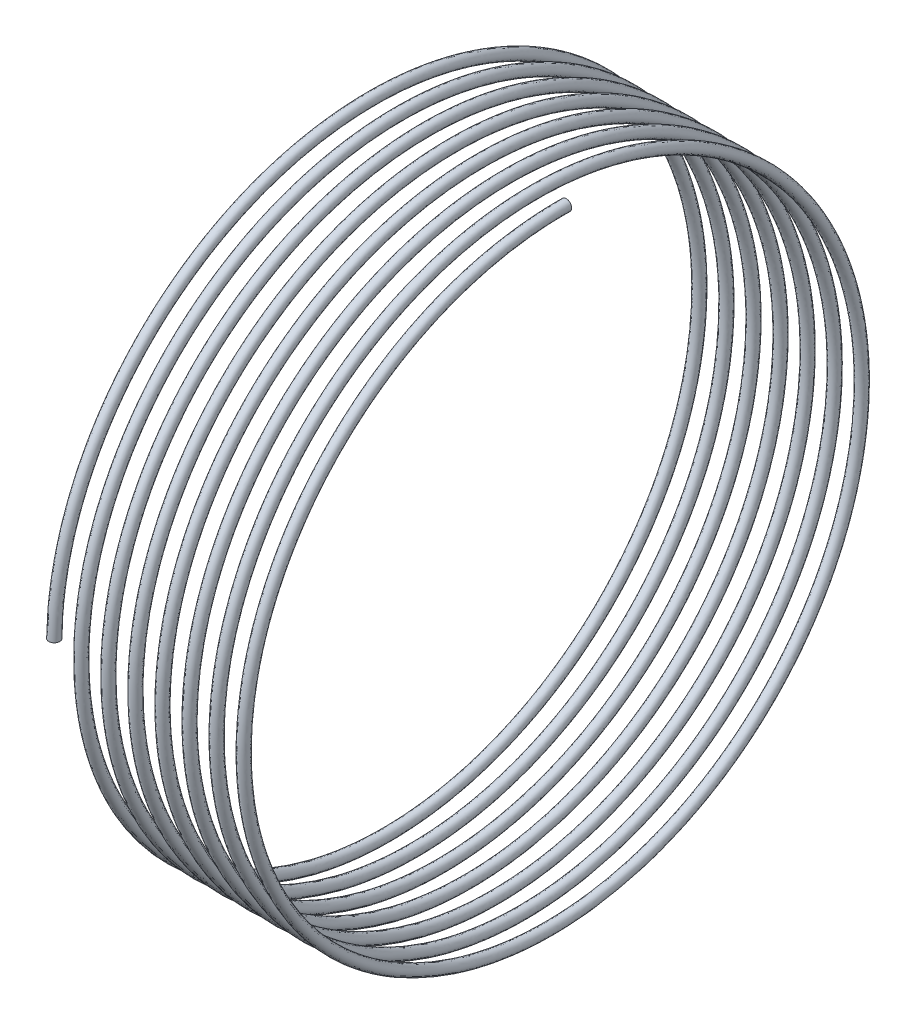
ISO-10303-21;
HEADER;
FILE_DESCRIPTION(('STEP AP214'),'2;1');
FILE_NAME('part.step','',(''),(''),'','','');
FILE_SCHEMA(('AUTOMOTIVE_DESIGN { 1 0 10303 214 1 1 1 1 }'));
ENDSEC;
DATA;
#1=APPLICATION_CONTEXT('core data for automotive mechanical design processes');
#2=APPLICATION_PROTOCOL_DEFINITION('international standard','automotive_design',2000,#1);
#3=PRODUCT_CONTEXT('',#1,'mechanical');
#4=PRODUCT('Part','Part','',(#3));
#5=PRODUCT_RELATED_PRODUCT_CATEGORY('part','',(#4));
#6=PRODUCT_DEFINITION_FORMATION('','',#4);
#7=PRODUCT_DEFINITION_CONTEXT('part definition',#1,'design');
#8=PRODUCT_DEFINITION('design','',#6,#7);
#9=PRODUCT_DEFINITION_SHAPE('','',#8);
#10=(LENGTH_UNIT() NAMED_UNIT(*) SI_UNIT(.MILLI.,.METRE.));
#11=(NAMED_UNIT(*) PLANE_ANGLE_UNIT() SI_UNIT($,.RADIAN.));
#12=(NAMED_UNIT(*) SI_UNIT($,.STERADIAN.) SOLID_ANGLE_UNIT());
#13=UNCERTAINTY_MEASURE_WITH_UNIT(LENGTH_MEASURE(1.E-05),#10,'distance_accuracy_value','');
#14=(GEOMETRIC_REPRESENTATION_CONTEXT(3) GLOBAL_UNCERTAINTY_ASSIGNED_CONTEXT((#13)) GLOBAL_UNIT_ASSIGNED_CONTEXT((#10,
#11,#12)) REPRESENTATION_CONTEXT('',''));
#15=CARTESIAN_POINT('',(0.,0.,0.));
#16=DIRECTION('',(0.,0.,1.));
#17=DIRECTION('',(1.,0.,0.));
#18=AXIS2_PLACEMENT_3D('',#15,#16,#17);
#19=CARTESIAN_POINT('',(-2.31975626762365E-08,2.93879437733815E-10,57.3278));
#20=DIRECTION('',(0.,-1.,5.12629889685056E-12));
#21=DIRECTION('',(0.,-5.12629889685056E-12,-1.));
#22=AXIS2_PLACEMENT_3D('',#19,#20,#21);
#23=PLANE('',#22);
#24=CARTESIAN_POINT('',(-2.31975627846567E-08,2.99005736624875E-10,58.3278));
#25=DIRECTION('',(0.,1.,-5.12629889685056E-12));
#26=DIRECTION('',(0.,5.12629889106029E-12,1.));
#27=AXIS2_PLACEMENT_3D('',#24,#25,#26);
#28=CIRCLE('',#27,1.);
#29=CARTESIAN_POINT('',(-2.31975628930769E-08,3.04132035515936E-10,59.3278));
#30=VERTEX_POINT('',#29);
#31=EDGE_CURVE('E42',#30,#30,#28,.T.);
#32=ORIENTED_EDGE('',*,*,#31,.F.);
#33=EDGE_LOOP('',(#32));
#34=FACE_BOUND('',#33,.T.);
#35=ADVANCED_FACE('F37',(#34),#23,.T.);
#36=CARTESIAN_POINT('',(36.2499989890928,57.3277999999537,7.28259979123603E-05));
#37=DIRECTION('',(0.,-1.27034349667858E-06,0.999999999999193));
#38=DIRECTION('',(0.,-0.999999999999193,-1.27034349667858E-06));
#39=AXIS2_PLACEMENT_3D('',#36,#37,#38);
#40=PLANE('',#39);
#41=CARTESIAN_POINT('',(36.2499989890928,58.3277999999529,7.40963414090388E-05));
#42=DIRECTION('',(0.,-1.27034349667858E-06,0.999999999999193));
#43=DIRECTION('',(0.,0.999999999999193,1.27034349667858E-06));
#44=AXIS2_PLACEMENT_3D('',#41,#42,#43);
#45=CIRCLE('',#44,1.);
#46=CARTESIAN_POINT('',(36.2499989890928,59.3277999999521,7.53666849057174E-05));
#47=VERTEX_POINT('',#46);
#48=EDGE_CURVE('E10',#47,#47,#45,.T.);
#49=ORIENTED_EDGE('',*,*,#48,.F.);
#50=EDGE_LOOP('',(#49));
#51=FACE_BOUND('',#50,.T.);
#52=ADVANCED_FACE('F45',(#51),#40,.F.);
#53=CARTESIAN_POINT('',(-2.31975628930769E-08,3.04132035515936E-10,59.3278));
#54=CARTESIAN_POINT('',(0.208332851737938,15.8967957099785,59.3277999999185));
#55=CARTESIAN_POINT('',(0.416665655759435,29.6638347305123,51.3794196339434));
#56=CARTESIAN_POINT('',(0.624998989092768,43.4309087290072,43.4310190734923));
#57=CARTESIAN_POINT('',(0.833332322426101,51.3793442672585,29.6639652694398));
#58=CARTESIAN_POINT('',(1.04166565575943,59.3277798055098,15.8969114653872));
#59=CARTESIAN_POINT('',(1.24999898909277,59.3277999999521,7.53666849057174E-05));
#60=CARTESIAN_POINT('',(1.4583323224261,59.3278201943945,-15.8967607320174));
#61=CARTESIAN_POINT('',(1.66666565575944,51.3794196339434,-29.6638347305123));
#62=CARTESIAN_POINT('',(1.87499898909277,43.4310190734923,-43.4309087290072));
#63=CARTESIAN_POINT('',(2.0833323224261,29.6639652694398,-51.3793442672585));
#64=CARTESIAN_POINT('',(2.29166565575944,15.8969114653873,-59.3277798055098));
#65=CARTESIAN_POINT('',(2.49999898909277,7.53666849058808E-05,-59.3277999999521));
#66=CARTESIAN_POINT('',(2.7083323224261,-15.8967607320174,-59.3278201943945));
#67=CARTESIAN_POINT('',(2.91666565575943,-29.6638347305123,-51.3794196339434));
#68=CARTESIAN_POINT('',(3.12499898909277,-43.4309087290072,-43.4310190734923));
#69=CARTESIAN_POINT('',(3.3333323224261,-51.3793442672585,-29.6639652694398));
#70=CARTESIAN_POINT('',(3.54166565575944,-59.3277798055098,-15.8969114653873));
#71=CARTESIAN_POINT('',(3.74999898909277,-59.3277999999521,-7.5366684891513E-05));
#72=CARTESIAN_POINT('',(3.9583323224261,-59.3278201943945,15.8967607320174));
#73=CARTESIAN_POINT('',(4.16666565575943,-51.3794196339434,29.6638347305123));
#74=CARTESIAN_POINT('',(4.37499898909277,-43.4310190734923,43.4309087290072));
#75=CARTESIAN_POINT('',(4.5833323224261,-29.6639652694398,51.3793442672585));
#76=CARTESIAN_POINT('',(4.79166565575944,-15.8969114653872,59.3277798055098));
#77=CARTESIAN_POINT('',(4.99999898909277,-7.53666848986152E-05,59.3277999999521));
#78=CARTESIAN_POINT('',(5.2083323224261,15.8967607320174,59.3278201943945));
#79=CARTESIAN_POINT('',(5.41666565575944,29.6638347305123,51.3794196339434));
#80=CARTESIAN_POINT('',(5.62499898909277,43.4309087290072,43.4310190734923));
#81=CARTESIAN_POINT('',(5.8333323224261,51.3793442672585,29.6639652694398));
#82=CARTESIAN_POINT('',(6.04166565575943,59.3277798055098,15.8969114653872));
#83=CARTESIAN_POINT('',(6.24999898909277,59.3277999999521,7.53666849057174E-05));
#84=CARTESIAN_POINT('',(6.4583323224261,59.3278201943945,-15.8967607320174));
#85=CARTESIAN_POINT('',(6.66666565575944,51.3794196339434,-29.6638347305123));
#86=CARTESIAN_POINT('',(6.87499898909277,43.4310190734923,-43.4309087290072));
#87=CARTESIAN_POINT('',(7.0833323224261,29.6639652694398,-51.3793442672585));
#88=CARTESIAN_POINT('',(7.29166565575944,15.8969114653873,-59.3277798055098));
#89=CARTESIAN_POINT('',(7.49999898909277,7.53666849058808E-05,-59.3277999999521));
#90=CARTESIAN_POINT('',(7.7083323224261,-15.8967607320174,-59.3278201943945));
#91=CARTESIAN_POINT('',(7.91666565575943,-29.6638347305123,-51.3794196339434));
#92=CARTESIAN_POINT('',(8.12499898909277,-43.4309087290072,-43.4310190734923));
#93=CARTESIAN_POINT('',(8.3333323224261,-51.3793442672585,-29.6639652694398));
#94=CARTESIAN_POINT('',(8.54166565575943,-59.3277798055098,-15.8969114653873));
#95=CARTESIAN_POINT('',(8.74999898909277,-59.3277999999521,-7.5366684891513E-05));
#96=CARTESIAN_POINT('',(8.9583323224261,-59.3278201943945,15.8967607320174));
#97=CARTESIAN_POINT('',(9.16666565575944,-51.3794196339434,29.6638347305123));
#98=CARTESIAN_POINT('',(9.37499898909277,-43.4310190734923,43.4309087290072));
#99=CARTESIAN_POINT('',(9.5833323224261,-29.6639652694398,51.3793442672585));
#100=CARTESIAN_POINT('',(9.79166565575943,-15.8969114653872,59.3277798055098));
#101=CARTESIAN_POINT('',(9.99999898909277,-7.53666848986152E-05,59.3277999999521));
#102=CARTESIAN_POINT('',(10.2083323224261,15.8967607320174,59.3278201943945));
#103=CARTESIAN_POINT('',(10.4166656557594,29.6638347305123,51.3794196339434));
#104=CARTESIAN_POINT('',(10.6249989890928,43.4309087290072,43.4310190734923));
#105=CARTESIAN_POINT('',(10.8333323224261,51.3793442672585,29.6639652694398));
#106=CARTESIAN_POINT('',(11.0416656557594,59.3277798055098,15.8969114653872));
#107=CARTESIAN_POINT('',(11.2499989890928,59.3277999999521,7.53666849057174E-05));
#108=CARTESIAN_POINT('',(11.4583323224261,59.3278201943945,-15.8967607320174));
#109=CARTESIAN_POINT('',(11.6666656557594,51.3794196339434,-29.6638347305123));
#110=CARTESIAN_POINT('',(11.8749989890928,43.4310190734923,-43.4309087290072));
#111=CARTESIAN_POINT('',(12.0833323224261,29.6639652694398,-51.3793442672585));
#112=CARTESIAN_POINT('',(12.2916656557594,15.8969114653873,-59.3277798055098));
#113=CARTESIAN_POINT('',(12.4999989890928,7.53666849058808E-05,-59.3277999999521));
#114=CARTESIAN_POINT('',(12.7083323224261,-15.8967607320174,-59.3278201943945));
#115=CARTESIAN_POINT('',(12.9166656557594,-29.6638347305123,-51.3794196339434));
#116=CARTESIAN_POINT('',(13.1249989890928,-43.4309087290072,-43.4310190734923));
#117=CARTESIAN_POINT('',(13.3333323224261,-51.3793442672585,-29.6639652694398));
#118=CARTESIAN_POINT('',(13.5416656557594,-59.3277798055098,-15.8969114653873));
#119=CARTESIAN_POINT('',(13.7499989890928,-59.3277999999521,-7.5366684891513E-05));
#120=CARTESIAN_POINT('',(13.9583323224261,-59.3278201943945,15.8967607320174));
#121=CARTESIAN_POINT('',(14.1666656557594,-51.3794196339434,29.6638347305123));
#122=CARTESIAN_POINT('',(14.3749989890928,-43.4310190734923,43.4309087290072));
#123=CARTESIAN_POINT('',(14.5833323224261,-29.6639652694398,51.3793442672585));
#124=CARTESIAN_POINT('',(14.7916656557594,-15.8969114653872,59.3277798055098));
#125=CARTESIAN_POINT('',(14.9999989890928,-7.53666848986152E-05,59.3277999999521));
#126=CARTESIAN_POINT('',(15.2083323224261,15.8967607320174,59.3278201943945));
#127=CARTESIAN_POINT('',(15.4166656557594,29.6638347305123,51.3794196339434));
#128=CARTESIAN_POINT('',(15.6249989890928,43.4309087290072,43.4310190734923));
#129=CARTESIAN_POINT('',(15.8333323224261,51.3793442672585,29.6639652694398));
#130=CARTESIAN_POINT('',(16.0416656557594,59.3277798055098,15.8969114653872));
#131=CARTESIAN_POINT('',(16.2499989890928,59.3277999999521,7.53666849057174E-05));
#132=CARTESIAN_POINT('',(16.4583323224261,59.3278201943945,-15.8967607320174));
#133=CARTESIAN_POINT('',(16.6666656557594,51.3794196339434,-29.6638347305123));
#134=CARTESIAN_POINT('',(16.8749989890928,43.4310190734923,-43.4309087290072));
#135=CARTESIAN_POINT('',(17.0833323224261,29.6639652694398,-51.3793442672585));
#136=CARTESIAN_POINT('',(17.2916656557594,15.8969114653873,-59.3277798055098));
#137=CARTESIAN_POINT('',(17.4999989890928,7.53666849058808E-05,-59.3277999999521));
#138=CARTESIAN_POINT('',(17.7083323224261,-15.8967607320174,-59.3278201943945));
#139=CARTESIAN_POINT('',(17.9166656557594,-29.6638347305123,-51.3794196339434));
#140=CARTESIAN_POINT('',(18.1249989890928,-43.4309087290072,-43.4310190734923));
#141=CARTESIAN_POINT('',(18.3333323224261,-51.3793442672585,-29.6639652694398));
#142=CARTESIAN_POINT('',(18.5416656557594,-59.3277798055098,-15.8969114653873));
#143=CARTESIAN_POINT('',(18.7499989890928,-59.3277999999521,-7.5366684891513E-05));
#144=CARTESIAN_POINT('',(18.9583323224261,-59.3278201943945,15.8967607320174));
#145=CARTESIAN_POINT('',(19.1666656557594,-51.3794196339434,29.6638347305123));
#146=CARTESIAN_POINT('',(19.3749989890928,-43.4310190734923,43.4309087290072));
#147=CARTESIAN_POINT('',(19.5833323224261,-29.6639652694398,51.3793442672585));
#148=CARTESIAN_POINT('',(19.7916656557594,-15.8969114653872,59.3277798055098));
#149=CARTESIAN_POINT('',(19.9999989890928,-7.53666848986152E-05,59.3277999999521));
#150=CARTESIAN_POINT('',(20.2083323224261,15.8967607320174,59.3278201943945));
#151=CARTESIAN_POINT('',(20.4166656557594,29.6638347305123,51.3794196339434));
#152=CARTESIAN_POINT('',(20.6249989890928,43.4309087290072,43.4310190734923));
#153=CARTESIAN_POINT('',(20.8333323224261,51.3793442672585,29.6639652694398));
#154=CARTESIAN_POINT('',(21.0416656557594,59.3277798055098,15.8969114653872));
#155=CARTESIAN_POINT('',(21.2499989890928,59.3277999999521,7.53666849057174E-05));
#156=CARTESIAN_POINT('',(21.4583323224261,59.3278201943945,-15.8967607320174));
#157=CARTESIAN_POINT('',(21.6666656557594,51.3794196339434,-29.6638347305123));
#158=CARTESIAN_POINT('',(21.8749989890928,43.4310190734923,-43.4309087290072));
#159=CARTESIAN_POINT('',(22.0833323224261,29.6639652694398,-51.3793442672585));
#160=CARTESIAN_POINT('',(22.2916656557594,15.8969114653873,-59.3277798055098));
#161=CARTESIAN_POINT('',(22.4999989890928,7.53666849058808E-05,-59.3277999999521));
#162=CARTESIAN_POINT('',(22.7083323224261,-15.8967607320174,-59.3278201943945));
#163=CARTESIAN_POINT('',(22.9166656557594,-29.6638347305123,-51.3794196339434));
#164=CARTESIAN_POINT('',(23.1249989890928,-43.4309087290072,-43.4310190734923));
#165=CARTESIAN_POINT('',(23.3333323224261,-51.3793442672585,-29.6639652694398));
#166=CARTESIAN_POINT('',(23.5416656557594,-59.3277798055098,-15.8969114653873));
#167=CARTESIAN_POINT('',(23.7499989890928,-59.3277999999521,-7.5366684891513E-05));
#168=CARTESIAN_POINT('',(23.9583323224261,-59.3278201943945,15.8967607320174));
#169=CARTESIAN_POINT('',(24.1666656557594,-51.3794196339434,29.6638347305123));
#170=CARTESIAN_POINT('',(24.3749989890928,-43.4310190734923,43.4309087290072));
#171=CARTESIAN_POINT('',(24.5833323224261,-29.6639652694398,51.3793442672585));
#172=CARTESIAN_POINT('',(24.7916656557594,-15.8969114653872,59.3277798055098));
#173=CARTESIAN_POINT('',(24.9999989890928,-7.53666848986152E-05,59.3277999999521));
#174=CARTESIAN_POINT('',(25.2083323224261,15.8967607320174,59.3278201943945));
#175=CARTESIAN_POINT('',(25.4166656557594,29.6638347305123,51.3794196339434));
#176=CARTESIAN_POINT('',(25.6249989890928,43.4309087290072,43.4310190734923));
#177=CARTESIAN_POINT('',(25.8333323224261,51.3793442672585,29.6639652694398));
#178=CARTESIAN_POINT('',(26.0416656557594,59.3277798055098,15.8969114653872));
#179=CARTESIAN_POINT('',(26.2499989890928,59.3277999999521,7.53666849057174E-05));
#180=CARTESIAN_POINT('',(26.4583323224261,59.3278201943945,-15.8967607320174));
#181=CARTESIAN_POINT('',(26.6666656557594,51.3794196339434,-29.6638347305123));
#182=CARTESIAN_POINT('',(26.8749989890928,43.4310190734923,-43.4309087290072));
#183=CARTESIAN_POINT('',(27.0833323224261,29.6639652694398,-51.3793442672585));
#184=CARTESIAN_POINT('',(27.2916656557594,15.8969114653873,-59.3277798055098));
#185=CARTESIAN_POINT('',(27.4999989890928,7.53666849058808E-05,-59.3277999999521));
#186=CARTESIAN_POINT('',(27.7083323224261,-15.8967607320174,-59.3278201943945));
#187=CARTESIAN_POINT('',(27.9166656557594,-29.6638347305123,-51.3794196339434));
#188=CARTESIAN_POINT('',(28.1249989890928,-43.4309087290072,-43.4310190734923));
#189=CARTESIAN_POINT('',(28.3333323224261,-51.3793442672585,-29.6639652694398));
#190=CARTESIAN_POINT('',(28.5416656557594,-59.3277798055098,-15.8969114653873));
#191=CARTESIAN_POINT('',(28.7499989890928,-59.3277999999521,-7.5366684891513E-05));
#192=CARTESIAN_POINT('',(28.9583323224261,-59.3278201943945,15.8967607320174));
#193=CARTESIAN_POINT('',(29.1666656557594,-51.3794196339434,29.6638347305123));
#194=CARTESIAN_POINT('',(29.3749989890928,-43.4310190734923,43.4309087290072));
#195=CARTESIAN_POINT('',(29.5833323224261,-29.6639652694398,51.3793442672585));
#196=CARTESIAN_POINT('',(29.7916656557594,-15.8969114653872,59.3277798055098));
#197=CARTESIAN_POINT('',(29.9999989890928,-7.53666848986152E-05,59.3277999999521));
#198=CARTESIAN_POINT('',(30.2083323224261,15.8967607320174,59.3278201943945));
#199=CARTESIAN_POINT('',(30.4166656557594,29.6638347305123,51.3794196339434));
#200=CARTESIAN_POINT('',(30.6249989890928,43.4309087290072,43.4310190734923));
#201=CARTESIAN_POINT('',(30.8333323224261,51.3793442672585,29.6639652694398));
#202=CARTESIAN_POINT('',(31.0416656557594,59.3277798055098,15.8969114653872));
#203=CARTESIAN_POINT('',(31.2499989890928,59.3277999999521,7.53666849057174E-05));
#204=CARTESIAN_POINT('',(31.4583323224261,59.3278201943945,-15.8967607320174));
#205=CARTESIAN_POINT('',(31.6666656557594,51.3794196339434,-29.6638347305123));
#206=CARTESIAN_POINT('',(31.8749989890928,43.4310190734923,-43.4309087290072));
#207=CARTESIAN_POINT('',(32.0833323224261,29.6639652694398,-51.3793442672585));
#208=CARTESIAN_POINT('',(32.2916656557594,15.8969114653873,-59.3277798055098));
#209=CARTESIAN_POINT('',(32.4999989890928,7.53666849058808E-05,-59.3277999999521));
#210=CARTESIAN_POINT('',(32.7083323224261,-15.8967607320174,-59.3278201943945));
#211=CARTESIAN_POINT('',(32.9166656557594,-29.6638347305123,-51.3794196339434));
#212=CARTESIAN_POINT('',(33.1249989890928,-43.4309087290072,-43.4310190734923));
#213=CARTESIAN_POINT('',(33.3333323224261,-51.3793442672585,-29.6639652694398));
#214=CARTESIAN_POINT('',(33.5416656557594,-59.3277798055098,-15.8969114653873));
#215=CARTESIAN_POINT('',(33.7499989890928,-59.3277999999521,-7.5366684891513E-05));
#216=CARTESIAN_POINT('',(33.9583323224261,-59.3278201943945,15.8967607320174));
#217=CARTESIAN_POINT('',(34.1666656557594,-51.3794196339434,29.6638347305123));
#218=CARTESIAN_POINT('',(34.3749989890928,-43.4310190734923,43.4309087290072));
#219=CARTESIAN_POINT('',(34.5833323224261,-29.6639652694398,51.3793442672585));
#220=CARTESIAN_POINT('',(34.7916656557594,-15.8969114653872,59.3277798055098));
#221=CARTESIAN_POINT('',(34.9999989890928,-7.53666848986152E-05,59.3277999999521));
#222=CARTESIAN_POINT('',(35.2083323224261,15.8967607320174,59.3278201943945));
#223=CARTESIAN_POINT('',(35.4166656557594,29.6638347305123,51.3794196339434));
#224=CARTESIAN_POINT('',(35.6249989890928,43.4309087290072,43.4310190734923));
#225=CARTESIAN_POINT('',(35.8333323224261,51.3793442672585,29.6639652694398));
#226=CARTESIAN_POINT('',(36.0416656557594,59.3277798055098,15.8969114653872));
#227=CARTESIAN_POINT('',(36.2499989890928,59.3277999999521,7.53666849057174E-05));
#228=CARTESIAN_POINT('',(1.99999997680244,3.04132035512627E-10,59.3278));
#229=CARTESIAN_POINT('',(2.20833285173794,15.8967957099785,59.3277999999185));
#230=CARTESIAN_POINT('',(2.41666565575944,29.6638347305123,51.3794196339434));
#231=CARTESIAN_POINT('',(2.62499898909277,43.4309087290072,43.4310190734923));
#232=CARTESIAN_POINT('',(2.8333323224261,51.3793442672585,29.6639652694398));
#233=CARTESIAN_POINT('',(3.04166565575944,59.3277798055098,15.8969114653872));
#234=CARTESIAN_POINT('',(3.24999898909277,59.3277999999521,7.53666849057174E-05));
#235=CARTESIAN_POINT('',(3.4583323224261,59.3278201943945,-15.8967607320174));
#236=CARTESIAN_POINT('',(3.66666565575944,51.3794196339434,-29.6638347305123));
#237=CARTESIAN_POINT('',(3.87499898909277,43.4310190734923,-43.4309087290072));
#238=CARTESIAN_POINT('',(4.0833323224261,29.6639652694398,-51.3793442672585));
#239=CARTESIAN_POINT('',(4.29166565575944,15.8969114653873,-59.3277798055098));
#240=CARTESIAN_POINT('',(4.49999898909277,7.53666849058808E-05,-59.3277999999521));
#241=CARTESIAN_POINT('',(4.7083323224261,-15.8967607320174,-59.3278201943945));
#242=CARTESIAN_POINT('',(4.91666565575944,-29.6638347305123,-51.3794196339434));
#243=CARTESIAN_POINT('',(5.12499898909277,-43.4309087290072,-43.4310190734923));
#244=CARTESIAN_POINT('',(5.3333323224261,-51.3793442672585,-29.6639652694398));
#245=CARTESIAN_POINT('',(5.54166565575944,-59.3277798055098,-15.8969114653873));
#246=CARTESIAN_POINT('',(5.74999898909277,-59.3277999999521,-7.5366684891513E-05));
#247=CARTESIAN_POINT('',(5.9583323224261,-59.3278201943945,15.8967607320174));
#248=CARTESIAN_POINT('',(6.16666565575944,-51.3794196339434,29.6638347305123));
#249=CARTESIAN_POINT('',(6.37499898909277,-43.4310190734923,43.4309087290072));
#250=CARTESIAN_POINT('',(6.5833323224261,-29.6639652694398,51.3793442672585));
#251=CARTESIAN_POINT('',(6.79166565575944,-15.8969114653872,59.3277798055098));
#252=CARTESIAN_POINT('',(6.99999898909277,-7.53666848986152E-05,59.3277999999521));
#253=CARTESIAN_POINT('',(7.20833232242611,15.8967607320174,59.3278201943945));
#254=CARTESIAN_POINT('',(7.41666565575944,29.6638347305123,51.3794196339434));
#255=CARTESIAN_POINT('',(7.62499898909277,43.4309087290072,43.4310190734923));
#256=CARTESIAN_POINT('',(7.8333323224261,51.3793442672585,29.6639652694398));
#257=CARTESIAN_POINT('',(8.04166565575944,59.3277798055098,15.8969114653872));
#258=CARTESIAN_POINT('',(8.24999898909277,59.3277999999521,7.53666849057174E-05));
#259=CARTESIAN_POINT('',(8.4583323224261,59.3278201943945,-15.8967607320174));
#260=CARTESIAN_POINT('',(8.66666565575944,51.3794196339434,-29.6638347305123));
#261=CARTESIAN_POINT('',(8.87499898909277,43.4310190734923,-43.4309087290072));
#262=CARTESIAN_POINT('',(9.0833323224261,29.6639652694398,-51.3793442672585));
#263=CARTESIAN_POINT('',(9.29166565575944,15.8969114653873,-59.3277798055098));
#264=CARTESIAN_POINT('',(9.49999898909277,7.53666849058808E-05,-59.3277999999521));
#265=CARTESIAN_POINT('',(9.70833232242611,-15.8967607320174,-59.3278201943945));
#266=CARTESIAN_POINT('',(9.91666565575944,-29.6638347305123,-51.3794196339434));
#267=CARTESIAN_POINT('',(10.1249989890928,-43.4309087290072,-43.4310190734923));
#268=CARTESIAN_POINT('',(10.3333323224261,-51.3793442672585,-29.6639652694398));
#269=CARTESIAN_POINT('',(10.5416656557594,-59.3277798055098,-15.8969114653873));
#270=CARTESIAN_POINT('',(10.7499989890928,-59.3277999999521,-7.5366684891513E-05));
#271=CARTESIAN_POINT('',(10.9583323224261,-59.3278201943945,15.8967607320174));
#272=CARTESIAN_POINT('',(11.1666656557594,-51.3794196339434,29.6638347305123));
#273=CARTESIAN_POINT('',(11.3749989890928,-43.4310190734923,43.4309087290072));
#274=CARTESIAN_POINT('',(11.5833323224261,-29.6639652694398,51.3793442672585));
#275=CARTESIAN_POINT('',(11.7916656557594,-15.8969114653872,59.3277798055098));
#276=CARTESIAN_POINT('',(11.9999989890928,-7.53666848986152E-05,59.3277999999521));
#277=CARTESIAN_POINT('',(12.2083323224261,15.8967607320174,59.3278201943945));
#278=CARTESIAN_POINT('',(12.4166656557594,29.6638347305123,51.3794196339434));
#279=CARTESIAN_POINT('',(12.6249989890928,43.4309087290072,43.4310190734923));
#280=CARTESIAN_POINT('',(12.8333323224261,51.3793442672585,29.6639652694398));
#281=CARTESIAN_POINT('',(13.0416656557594,59.3277798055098,15.8969114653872));
#282=CARTESIAN_POINT('',(13.2499989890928,59.3277999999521,7.53666849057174E-05));
#283=CARTESIAN_POINT('',(13.4583323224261,59.3278201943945,-15.8967607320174));
#284=CARTESIAN_POINT('',(13.6666656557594,51.3794196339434,-29.6638347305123));
#285=CARTESIAN_POINT('',(13.8749989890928,43.4310190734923,-43.4309087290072));
#286=CARTESIAN_POINT('',(14.0833323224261,29.6639652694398,-51.3793442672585));
#287=CARTESIAN_POINT('',(14.2916656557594,15.8969114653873,-59.3277798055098));
#288=CARTESIAN_POINT('',(14.4999989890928,7.53666849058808E-05,-59.3277999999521));
#289=CARTESIAN_POINT('',(14.7083323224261,-15.8967607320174,-59.3278201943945));
#290=CARTESIAN_POINT('',(14.9166656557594,-29.6638347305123,-51.3794196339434));
#291=CARTESIAN_POINT('',(15.1249989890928,-43.4309087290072,-43.4310190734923));
#292=CARTESIAN_POINT('',(15.3333323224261,-51.3793442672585,-29.6639652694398));
#293=CARTESIAN_POINT('',(15.5416656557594,-59.3277798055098,-15.8969114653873));
#294=CARTESIAN_POINT('',(15.7499989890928,-59.3277999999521,-7.5366684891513E-05));
#295=CARTESIAN_POINT('',(15.9583323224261,-59.3278201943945,15.8967607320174));
#296=CARTESIAN_POINT('',(16.1666656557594,-51.3794196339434,29.6638347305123));
#297=CARTESIAN_POINT('',(16.3749989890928,-43.4310190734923,43.4309087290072));
#298=CARTESIAN_POINT('',(16.5833323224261,-29.6639652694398,51.3793442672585));
#299=CARTESIAN_POINT('',(16.7916656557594,-15.8969114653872,59.3277798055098));
#300=CARTESIAN_POINT('',(16.9999989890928,-7.53666848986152E-05,59.3277999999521));
#301=CARTESIAN_POINT('',(17.2083323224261,15.8967607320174,59.3278201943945));
#302=CARTESIAN_POINT('',(17.4166656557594,29.6638347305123,51.3794196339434));
#303=CARTESIAN_POINT('',(17.6249989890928,43.4309087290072,43.4310190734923));
#304=CARTESIAN_POINT('',(17.8333323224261,51.3793442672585,29.6639652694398));
#305=CARTESIAN_POINT('',(18.0416656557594,59.3277798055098,15.8969114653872));
#306=CARTESIAN_POINT('',(18.2499989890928,59.3277999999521,7.53666849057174E-05));
#307=CARTESIAN_POINT('',(18.4583323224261,59.3278201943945,-15.8967607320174));
#308=CARTESIAN_POINT('',(18.6666656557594,51.3794196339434,-29.6638347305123));
#309=CARTESIAN_POINT('',(18.8749989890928,43.4310190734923,-43.4309087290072));
#310=CARTESIAN_POINT('',(19.0833323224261,29.6639652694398,-51.3793442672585));
#311=CARTESIAN_POINT('',(19.2916656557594,15.8969114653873,-59.3277798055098));
#312=CARTESIAN_POINT('',(19.4999989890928,7.53666849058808E-05,-59.3277999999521));
#313=CARTESIAN_POINT('',(19.7083323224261,-15.8967607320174,-59.3278201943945));
#314=CARTESIAN_POINT('',(19.9166656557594,-29.6638347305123,-51.3794196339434));
#315=CARTESIAN_POINT('',(20.1249989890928,-43.4309087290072,-43.4310190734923));
#316=CARTESIAN_POINT('',(20.3333323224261,-51.3793442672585,-29.6639652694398));
#317=CARTESIAN_POINT('',(20.5416656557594,-59.3277798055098,-15.8969114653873));
#318=CARTESIAN_POINT('',(20.7499989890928,-59.3277999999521,-7.5366684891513E-05));
#319=CARTESIAN_POINT('',(20.9583323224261,-59.3278201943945,15.8967607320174));
#320=CARTESIAN_POINT('',(21.1666656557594,-51.3794196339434,29.6638347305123));
#321=CARTESIAN_POINT('',(21.3749989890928,-43.4310190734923,43.4309087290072));
#322=CARTESIAN_POINT('',(21.5833323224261,-29.6639652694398,51.3793442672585));
#323=CARTESIAN_POINT('',(21.7916656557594,-15.8969114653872,59.3277798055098));
#324=CARTESIAN_POINT('',(21.9999989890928,-7.53666848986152E-05,59.3277999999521));
#325=CARTESIAN_POINT('',(22.2083323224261,15.8967607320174,59.3278201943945));
#326=CARTESIAN_POINT('',(22.4166656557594,29.6638347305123,51.3794196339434));
#327=CARTESIAN_POINT('',(22.6249989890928,43.4309087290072,43.4310190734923));
#328=CARTESIAN_POINT('',(22.8333323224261,51.3793442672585,29.6639652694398));
#329=CARTESIAN_POINT('',(23.0416656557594,59.3277798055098,15.8969114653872));
#330=CARTESIAN_POINT('',(23.2499989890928,59.3277999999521,7.53666849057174E-05));
#331=CARTESIAN_POINT('',(23.4583323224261,59.3278201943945,-15.8967607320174));
#332=CARTESIAN_POINT('',(23.6666656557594,51.3794196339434,-29.6638347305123));
#333=CARTESIAN_POINT('',(23.8749989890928,43.4310190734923,-43.4309087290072));
#334=CARTESIAN_POINT('',(24.0833323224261,29.6639652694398,-51.3793442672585));
#335=CARTESIAN_POINT('',(24.2916656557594,15.8969114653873,-59.3277798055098));
#336=CARTESIAN_POINT('',(24.4999989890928,7.53666849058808E-05,-59.3277999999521));
#337=CARTESIAN_POINT('',(24.7083323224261,-15.8967607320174,-59.3278201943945));
#338=CARTESIAN_POINT('',(24.9166656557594,-29.6638347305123,-51.3794196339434));
#339=CARTESIAN_POINT('',(25.1249989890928,-43.4309087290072,-43.4310190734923));
#340=CARTESIAN_POINT('',(25.3333323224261,-51.3793442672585,-29.6639652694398));
#341=CARTESIAN_POINT('',(25.5416656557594,-59.3277798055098,-15.8969114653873));
#342=CARTESIAN_POINT('',(25.7499989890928,-59.3277999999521,-7.5366684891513E-05));
#343=CARTESIAN_POINT('',(25.9583323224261,-59.3278201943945,15.8967607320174));
#344=CARTESIAN_POINT('',(26.1666656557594,-51.3794196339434,29.6638347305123));
#345=CARTESIAN_POINT('',(26.3749989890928,-43.4310190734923,43.4309087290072));
#346=CARTESIAN_POINT('',(26.5833323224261,-29.6639652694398,51.3793442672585));
#347=CARTESIAN_POINT('',(26.7916656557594,-15.8969114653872,59.3277798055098));
#348=CARTESIAN_POINT('',(26.9999989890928,-7.53666848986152E-05,59.3277999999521));
#349=CARTESIAN_POINT('',(27.2083323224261,15.8967607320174,59.3278201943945));
#350=CARTESIAN_POINT('',(27.4166656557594,29.6638347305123,51.3794196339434));
#351=CARTESIAN_POINT('',(27.6249989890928,43.4309087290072,43.4310190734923));
#352=CARTESIAN_POINT('',(27.8333323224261,51.3793442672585,29.6639652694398));
#353=CARTESIAN_POINT('',(28.0416656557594,59.3277798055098,15.8969114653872));
#354=CARTESIAN_POINT('',(28.2499989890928,59.3277999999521,7.53666849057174E-05));
#355=CARTESIAN_POINT('',(28.4583323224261,59.3278201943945,-15.8967607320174));
#356=CARTESIAN_POINT('',(28.6666656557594,51.3794196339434,-29.6638347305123));
#357=CARTESIAN_POINT('',(28.8749989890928,43.4310190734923,-43.4309087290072));
#358=CARTESIAN_POINT('',(29.0833323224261,29.6639652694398,-51.3793442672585));
#359=CARTESIAN_POINT('',(29.2916656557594,15.8969114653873,-59.3277798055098));
#360=CARTESIAN_POINT('',(29.4999989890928,7.53666849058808E-05,-59.3277999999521));
#361=CARTESIAN_POINT('',(29.7083323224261,-15.8967607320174,-59.3278201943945));
#362=CARTESIAN_POINT('',(29.9166656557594,-29.6638347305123,-51.3794196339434));
#363=CARTESIAN_POINT('',(30.1249989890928,-43.4309087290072,-43.4310190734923));
#364=CARTESIAN_POINT('',(30.3333323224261,-51.3793442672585,-29.6639652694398));
#365=CARTESIAN_POINT('',(30.5416656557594,-59.3277798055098,-15.8969114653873));
#366=CARTESIAN_POINT('',(30.7499989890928,-59.3277999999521,-7.5366684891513E-05));
#367=CARTESIAN_POINT('',(30.9583323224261,-59.3278201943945,15.8967607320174));
#368=CARTESIAN_POINT('',(31.1666656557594,-51.3794196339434,29.6638347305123));
#369=CARTESIAN_POINT('',(31.3749989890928,-43.4310190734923,43.4309087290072));
#370=CARTESIAN_POINT('',(31.5833323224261,-29.6639652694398,51.3793442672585));
#371=CARTESIAN_POINT('',(31.7916656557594,-15.8969114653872,59.3277798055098));
#372=CARTESIAN_POINT('',(31.9999989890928,-7.53666848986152E-05,59.3277999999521));
#373=CARTESIAN_POINT('',(32.2083323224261,15.8967607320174,59.3278201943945));
#374=CARTESIAN_POINT('',(32.4166656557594,29.6638347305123,51.3794196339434));
#375=CARTESIAN_POINT('',(32.6249989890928,43.4309087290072,43.4310190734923));
#376=CARTESIAN_POINT('',(32.8333323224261,51.3793442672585,29.6639652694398));
#377=CARTESIAN_POINT('',(33.0416656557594,59.3277798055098,15.8969114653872));
#378=CARTESIAN_POINT('',(33.2499989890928,59.3277999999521,7.53666849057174E-05));
#379=CARTESIAN_POINT('',(33.4583323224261,59.3278201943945,-15.8967607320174));
#380=CARTESIAN_POINT('',(33.6666656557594,51.3794196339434,-29.6638347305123));
#381=CARTESIAN_POINT('',(33.8749989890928,43.4310190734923,-43.4309087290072));
#382=CARTESIAN_POINT('',(34.0833323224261,29.6639652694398,-51.3793442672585));
#383=CARTESIAN_POINT('',(34.2916656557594,15.8969114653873,-59.3277798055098));
#384=CARTESIAN_POINT('',(34.4999989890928,7.53666849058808E-05,-59.3277999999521));
#385=CARTESIAN_POINT('',(34.7083323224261,-15.8967607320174,-59.3278201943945));
#386=CARTESIAN_POINT('',(34.9166656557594,-29.6638347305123,-51.3794196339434));
#387=CARTESIAN_POINT('',(35.1249989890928,-43.4309087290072,-43.4310190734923));
#388=CARTESIAN_POINT('',(35.3333323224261,-51.3793442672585,-29.6639652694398));
#389=CARTESIAN_POINT('',(35.5416656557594,-59.3277798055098,-15.8969114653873));
#390=CARTESIAN_POINT('',(35.7499989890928,-59.3277999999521,-7.5366684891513E-05));
#391=CARTESIAN_POINT('',(35.9583323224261,-59.3278201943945,15.8967607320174));
#392=CARTESIAN_POINT('',(36.1666656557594,-51.3794196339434,29.6638347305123));
#393=CARTESIAN_POINT('',(36.3749989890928,-43.4310190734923,43.4309087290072));
#394=CARTESIAN_POINT('',(36.5833323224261,-29.6639652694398,51.3793442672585));
#395=CARTESIAN_POINT('',(36.7916656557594,-15.8969114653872,59.3277798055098));
#396=CARTESIAN_POINT('',(36.9999989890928,-7.53666848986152E-05,59.3277999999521));
#397=CARTESIAN_POINT('',(37.2083323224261,15.8967607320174,59.3278201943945));
#398=CARTESIAN_POINT('',(37.4166656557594,29.6638347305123,51.3794196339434));
#399=CARTESIAN_POINT('',(37.6249989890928,43.4309087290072,43.4310190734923));
#400=CARTESIAN_POINT('',(37.8333323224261,51.3793442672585,29.6639652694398));
#401=CARTESIAN_POINT('',(38.0416656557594,59.3277798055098,15.8969114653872));
#402=CARTESIAN_POINT('',(38.2499989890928,59.3277999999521,7.53666849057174E-05));
#403=CARTESIAN_POINT('',(1.99999997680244,2.93879437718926E-10,57.3278));
#404=CARTESIAN_POINT('',(2.20833285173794,15.3608986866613,57.3277999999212));
#405=CARTESIAN_POINT('',(2.41666565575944,28.6638369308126,49.6473675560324));
#406=CARTESIAN_POINT('',(2.62499898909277,41.9668089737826,41.9669155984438));
#407=CARTESIAN_POINT('',(2.8333323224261,49.6472947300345,28.6639630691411));
#408=CARTESIAN_POINT('',(3.04166565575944,57.3277804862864,15.3610105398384));
#409=CARTESIAN_POINT('',(3.24999898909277,57.3277999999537,7.28259979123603E-05));
#410=CARTESIAN_POINT('',(3.4583323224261,57.3278195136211,-15.3608648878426));
#411=CARTESIAN_POINT('',(3.66666565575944,49.6473675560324,-28.6638369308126));
#412=CARTESIAN_POINT('',(3.87499898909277,41.9669155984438,-41.9668089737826));
#413=CARTESIAN_POINT('',(4.0833323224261,28.6639630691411,-49.6472947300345));
#414=CARTESIAN_POINT('',(4.29166565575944,15.3610105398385,-57.3277804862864));
#415=CARTESIAN_POINT('',(4.49999898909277,7.28259979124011E-05,-57.3277999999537));
#416=CARTESIAN_POINT('',(4.7083323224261,-15.3608648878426,-57.3278195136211));
#417=CARTESIAN_POINT('',(4.91666565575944,-28.6638369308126,-49.6473675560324));
#418=CARTESIAN_POINT('',(5.12499898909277,-41.9668089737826,-41.9669155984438));
#419=CARTESIAN_POINT('',(5.3333323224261,-49.6472947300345,-28.6639630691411));
#420=CARTESIAN_POINT('',(5.54166565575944,-57.3277804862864,-15.3610105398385));
#421=CARTESIAN_POINT('',(5.74999898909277,-57.3277999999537,-7.28259978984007E-05));
#422=CARTESIAN_POINT('',(5.9583323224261,-57.3278195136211,15.3608648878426));
#423=CARTESIAN_POINT('',(6.16666565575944,-49.6473675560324,28.6638369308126));
#424=CARTESIAN_POINT('',(6.37499898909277,-41.9669155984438,41.9668089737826));
#425=CARTESIAN_POINT('',(6.5833323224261,-28.6639630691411,49.6472947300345));
#426=CARTESIAN_POINT('',(6.79166565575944,-15.3610105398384,57.3277804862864));
#427=CARTESIAN_POINT('',(6.99999898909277,-7.28259979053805E-05,57.3277999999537));
#428=CARTESIAN_POINT('',(7.20833232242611,15.3608648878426,57.3278195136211));
#429=CARTESIAN_POINT('',(7.41666565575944,28.6638369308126,49.6473675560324));
#430=CARTESIAN_POINT('',(7.62499898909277,41.9668089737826,41.9669155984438));
#431=CARTESIAN_POINT('',(7.8333323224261,49.6472947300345,28.6639630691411));
#432=CARTESIAN_POINT('',(8.04166565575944,57.3277804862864,15.3610105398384));
#433=CARTESIAN_POINT('',(8.24999898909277,57.3277999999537,7.28259979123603E-05));
#434=CARTESIAN_POINT('',(8.45833232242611,57.3278195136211,-15.3608648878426));
#435=CARTESIAN_POINT('',(8.66666565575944,49.6473675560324,-28.6638369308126));
#436=CARTESIAN_POINT('',(8.87499898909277,41.9669155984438,-41.9668089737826));
#437=CARTESIAN_POINT('',(9.0833323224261,28.6639630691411,-49.6472947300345));
#438=CARTESIAN_POINT('',(9.29166565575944,15.3610105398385,-57.3277804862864));
#439=CARTESIAN_POINT('',(9.49999898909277,7.28259979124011E-05,-57.3277999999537));
#440=CARTESIAN_POINT('',(9.70833232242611,-15.3608648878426,-57.3278195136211));
#441=CARTESIAN_POINT('',(9.91666565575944,-28.6638369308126,-49.6473675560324));
#442=CARTESIAN_POINT('',(10.1249989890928,-41.9668089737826,-41.9669155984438));
#443=CARTESIAN_POINT('',(10.3333323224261,-49.6472947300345,-28.6639630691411));
#444=CARTESIAN_POINT('',(10.5416656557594,-57.3277804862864,-15.3610105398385));
#445=CARTESIAN_POINT('',(10.7499989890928,-57.3277999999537,-7.28259978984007E-05));
#446=CARTESIAN_POINT('',(10.9583323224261,-57.3278195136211,15.3608648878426));
#447=CARTESIAN_POINT('',(11.1666656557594,-49.6473675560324,28.6638369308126));
#448=CARTESIAN_POINT('',(11.3749989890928,-41.9669155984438,41.9668089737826));
#449=CARTESIAN_POINT('',(11.5833323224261,-28.6639630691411,49.6472947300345));
#450=CARTESIAN_POINT('',(11.7916656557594,-15.3610105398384,57.3277804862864));
#451=CARTESIAN_POINT('',(11.9999989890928,-7.28259979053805E-05,57.3277999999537));
#452=CARTESIAN_POINT('',(12.2083323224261,15.3608648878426,57.3278195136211));
#453=CARTESIAN_POINT('',(12.4166656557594,28.6638369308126,49.6473675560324));
#454=CARTESIAN_POINT('',(12.6249989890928,41.9668089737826,41.9669155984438));
#455=CARTESIAN_POINT('',(12.8333323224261,49.6472947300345,28.6639630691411));
#456=CARTESIAN_POINT('',(13.0416656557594,57.3277804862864,15.3610105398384));
#457=CARTESIAN_POINT('',(13.2499989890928,57.3277999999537,7.28259979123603E-05));
#458=CARTESIAN_POINT('',(13.4583323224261,57.3278195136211,-15.3608648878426));
#459=CARTESIAN_POINT('',(13.6666656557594,49.6473675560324,-28.6638369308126));
#460=CARTESIAN_POINT('',(13.8749989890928,41.9669155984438,-41.9668089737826));
#461=CARTESIAN_POINT('',(14.0833323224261,28.6639630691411,-49.6472947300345));
#462=CARTESIAN_POINT('',(14.2916656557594,15.3610105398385,-57.3277804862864));
#463=CARTESIAN_POINT('',(14.4999989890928,7.28259979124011E-05,-57.3277999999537));
#464=CARTESIAN_POINT('',(14.7083323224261,-15.3608648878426,-57.3278195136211));
#465=CARTESIAN_POINT('',(14.9166656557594,-28.6638369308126,-49.6473675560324));
#466=CARTESIAN_POINT('',(15.1249989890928,-41.9668089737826,-41.9669155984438));
#467=CARTESIAN_POINT('',(15.3333323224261,-49.6472947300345,-28.6639630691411));
#468=CARTESIAN_POINT('',(15.5416656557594,-57.3277804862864,-15.3610105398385));
#469=CARTESIAN_POINT('',(15.7499989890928,-57.3277999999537,-7.28259978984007E-05));
#470=CARTESIAN_POINT('',(15.9583323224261,-57.3278195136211,15.3608648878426));
#471=CARTESIAN_POINT('',(16.1666656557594,-49.6473675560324,28.6638369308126));
#472=CARTESIAN_POINT('',(16.3749989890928,-41.9669155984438,41.9668089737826));
#473=CARTESIAN_POINT('',(16.5833323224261,-28.6639630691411,49.6472947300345));
#474=CARTESIAN_POINT('',(16.7916656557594,-15.3610105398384,57.3277804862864));
#475=CARTESIAN_POINT('',(16.9999989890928,-7.28259979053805E-05,57.3277999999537));
#476=CARTESIAN_POINT('',(17.2083323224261,15.3608648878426,57.3278195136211));
#477=CARTESIAN_POINT('',(17.4166656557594,28.6638369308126,49.6473675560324));
#478=CARTESIAN_POINT('',(17.6249989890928,41.9668089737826,41.9669155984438));
#479=CARTESIAN_POINT('',(17.8333323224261,49.6472947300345,28.6639630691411));
#480=CARTESIAN_POINT('',(18.0416656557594,57.3277804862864,15.3610105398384));
#481=CARTESIAN_POINT('',(18.2499989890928,57.3277999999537,7.28259979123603E-05));
#482=CARTESIAN_POINT('',(18.4583323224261,57.3278195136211,-15.3608648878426));
#483=CARTESIAN_POINT('',(18.6666656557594,49.6473675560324,-28.6638369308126));
#484=CARTESIAN_POINT('',(18.8749989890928,41.9669155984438,-41.9668089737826));
#485=CARTESIAN_POINT('',(19.0833323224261,28.6639630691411,-49.6472947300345));
#486=CARTESIAN_POINT('',(19.2916656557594,15.3610105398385,-57.3277804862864));
#487=CARTESIAN_POINT('',(19.4999989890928,7.28259979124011E-05,-57.3277999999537));
#488=CARTESIAN_POINT('',(19.7083323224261,-15.3608648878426,-57.3278195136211));
#489=CARTESIAN_POINT('',(19.9166656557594,-28.6638369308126,-49.6473675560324));
#490=CARTESIAN_POINT('',(20.1249989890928,-41.9668089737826,-41.9669155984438));
#491=CARTESIAN_POINT('',(20.3333323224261,-49.6472947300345,-28.6639630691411));
#492=CARTESIAN_POINT('',(20.5416656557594,-57.3277804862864,-15.3610105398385));
#493=CARTESIAN_POINT('',(20.7499989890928,-57.3277999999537,-7.28259978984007E-05));
#494=CARTESIAN_POINT('',(20.9583323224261,-57.3278195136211,15.3608648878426));
#495=CARTESIAN_POINT('',(21.1666656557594,-49.6473675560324,28.6638369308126));
#496=CARTESIAN_POINT('',(21.3749989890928,-41.9669155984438,41.9668089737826));
#497=CARTESIAN_POINT('',(21.5833323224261,-28.6639630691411,49.6472947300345));
#498=CARTESIAN_POINT('',(21.7916656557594,-15.3610105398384,57.3277804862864));
#499=CARTESIAN_POINT('',(21.9999989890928,-7.28259979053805E-05,57.3277999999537));
#500=CARTESIAN_POINT('',(22.2083323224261,15.3608648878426,57.3278195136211));
#501=CARTESIAN_POINT('',(22.4166656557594,28.6638369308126,49.6473675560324));
#502=CARTESIAN_POINT('',(22.6249989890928,41.9668089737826,41.9669155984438));
#503=CARTESIAN_POINT('',(22.8333323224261,49.6472947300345,28.6639630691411));
#504=CARTESIAN_POINT('',(23.0416656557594,57.3277804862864,15.3610105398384));
#505=CARTESIAN_POINT('',(23.2499989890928,57.3277999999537,7.28259979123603E-05));
#506=CARTESIAN_POINT('',(23.4583323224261,57.3278195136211,-15.3608648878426));
#507=CARTESIAN_POINT('',(23.6666656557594,49.6473675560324,-28.6638369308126));
#508=CARTESIAN_POINT('',(23.8749989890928,41.9669155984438,-41.9668089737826));
#509=CARTESIAN_POINT('',(24.0833323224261,28.6639630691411,-49.6472947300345));
#510=CARTESIAN_POINT('',(24.2916656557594,15.3610105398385,-57.3277804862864));
#511=CARTESIAN_POINT('',(24.4999989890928,7.28259979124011E-05,-57.3277999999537));
#512=CARTESIAN_POINT('',(24.7083323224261,-15.3608648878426,-57.3278195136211));
#513=CARTESIAN_POINT('',(24.9166656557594,-28.6638369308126,-49.6473675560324));
#514=CARTESIAN_POINT('',(25.1249989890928,-41.9668089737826,-41.9669155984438));
#515=CARTESIAN_POINT('',(25.3333323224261,-49.6472947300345,-28.6639630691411));
#516=CARTESIAN_POINT('',(25.5416656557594,-57.3277804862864,-15.3610105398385));
#517=CARTESIAN_POINT('',(25.7499989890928,-57.3277999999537,-7.28259978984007E-05));
#518=CARTESIAN_POINT('',(25.9583323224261,-57.3278195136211,15.3608648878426));
#519=CARTESIAN_POINT('',(26.1666656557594,-49.6473675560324,28.6638369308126));
#520=CARTESIAN_POINT('',(26.3749989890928,-41.9669155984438,41.9668089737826));
#521=CARTESIAN_POINT('',(26.5833323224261,-28.6639630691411,49.6472947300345));
#522=CARTESIAN_POINT('',(26.7916656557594,-15.3610105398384,57.3277804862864));
#523=CARTESIAN_POINT('',(26.9999989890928,-7.28259979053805E-05,57.3277999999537));
#524=CARTESIAN_POINT('',(27.2083323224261,15.3608648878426,57.3278195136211));
#525=CARTESIAN_POINT('',(27.4166656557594,28.6638369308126,49.6473675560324));
#526=CARTESIAN_POINT('',(27.6249989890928,41.9668089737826,41.9669155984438));
#527=CARTESIAN_POINT('',(27.8333323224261,49.6472947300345,28.6639630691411));
#528=CARTESIAN_POINT('',(28.0416656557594,57.3277804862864,15.3610105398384));
#529=CARTESIAN_POINT('',(28.2499989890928,57.3277999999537,7.28259979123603E-05));
#530=CARTESIAN_POINT('',(28.4583323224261,57.3278195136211,-15.3608648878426));
#531=CARTESIAN_POINT('',(28.6666656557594,49.6473675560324,-28.6638369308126));
#532=CARTESIAN_POINT('',(28.8749989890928,41.9669155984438,-41.9668089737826));
#533=CARTESIAN_POINT('',(29.0833323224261,28.6639630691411,-49.6472947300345));
#534=CARTESIAN_POINT('',(29.2916656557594,15.3610105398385,-57.3277804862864));
#535=CARTESIAN_POINT('',(29.4999989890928,7.28259979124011E-05,-57.3277999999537));
#536=CARTESIAN_POINT('',(29.7083323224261,-15.3608648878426,-57.3278195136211));
#537=CARTESIAN_POINT('',(29.9166656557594,-28.6638369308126,-49.6473675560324));
#538=CARTESIAN_POINT('',(30.1249989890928,-41.9668089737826,-41.9669155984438));
#539=CARTESIAN_POINT('',(30.3333323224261,-49.6472947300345,-28.6639630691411));
#540=CARTESIAN_POINT('',(30.5416656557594,-57.3277804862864,-15.3610105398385));
#541=CARTESIAN_POINT('',(30.7499989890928,-57.3277999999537,-7.28259978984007E-05));
#542=CARTESIAN_POINT('',(30.9583323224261,-57.3278195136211,15.3608648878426));
#543=CARTESIAN_POINT('',(31.1666656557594,-49.6473675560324,28.6638369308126));
#544=CARTESIAN_POINT('',(31.3749989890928,-41.9669155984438,41.9668089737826));
#545=CARTESIAN_POINT('',(31.5833323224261,-28.6639630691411,49.6472947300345));
#546=CARTESIAN_POINT('',(31.7916656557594,-15.3610105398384,57.3277804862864));
#547=CARTESIAN_POINT('',(31.9999989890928,-7.28259979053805E-05,57.3277999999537));
#548=CARTESIAN_POINT('',(32.2083323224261,15.3608648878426,57.3278195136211));
#549=CARTESIAN_POINT('',(32.4166656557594,28.6638369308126,49.6473675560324));
#550=CARTESIAN_POINT('',(32.6249989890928,41.9668089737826,41.9669155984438));
#551=CARTESIAN_POINT('',(32.8333323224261,49.6472947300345,28.6639630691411));
#552=CARTESIAN_POINT('',(33.0416656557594,57.3277804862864,15.3610105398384));
#553=CARTESIAN_POINT('',(33.2499989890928,57.3277999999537,7.28259979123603E-05));
#554=CARTESIAN_POINT('',(33.4583323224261,57.3278195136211,-15.3608648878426));
#555=CARTESIAN_POINT('',(33.6666656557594,49.6473675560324,-28.6638369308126));
#556=CARTESIAN_POINT('',(33.8749989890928,41.9669155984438,-41.9668089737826));
#557=CARTESIAN_POINT('',(34.0833323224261,28.6639630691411,-49.6472947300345));
#558=CARTESIAN_POINT('',(34.2916656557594,15.3610105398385,-57.3277804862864));
#559=CARTESIAN_POINT('',(34.4999989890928,7.28259979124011E-05,-57.3277999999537));
#560=CARTESIAN_POINT('',(34.7083323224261,-15.3608648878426,-57.3278195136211));
#561=CARTESIAN_POINT('',(34.9166656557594,-28.6638369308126,-49.6473675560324));
#562=CARTESIAN_POINT('',(35.1249989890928,-41.9668089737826,-41.9669155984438));
#563=CARTESIAN_POINT('',(35.3333323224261,-49.6472947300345,-28.6639630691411));
#564=CARTESIAN_POINT('',(35.5416656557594,-57.3277804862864,-15.3610105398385));
#565=CARTESIAN_POINT('',(35.7499989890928,-57.3277999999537,-7.28259978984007E-05));
#566=CARTESIAN_POINT('',(35.9583323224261,-57.3278195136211,15.3608648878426));
#567=CARTESIAN_POINT('',(36.1666656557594,-49.6473675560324,28.6638369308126));
#568=CARTESIAN_POINT('',(36.3749989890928,-41.9669155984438,41.9668089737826));
#569=CARTESIAN_POINT('',(36.5833323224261,-28.6639630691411,49.6472947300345));
#570=CARTESIAN_POINT('',(36.7916656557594,-15.3610105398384,57.3277804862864));
#571=CARTESIAN_POINT('',(36.9999989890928,-7.28259979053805E-05,57.3277999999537));
#572=CARTESIAN_POINT('',(37.2083323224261,15.3608648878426,57.3278195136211));
#573=CARTESIAN_POINT('',(37.4166656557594,28.6638369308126,49.6473675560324));
#574=CARTESIAN_POINT('',(37.6249989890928,41.9668089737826,41.9669155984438));
#575=CARTESIAN_POINT('',(37.8333323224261,49.6472947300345,28.6639630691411));
#576=CARTESIAN_POINT('',(38.0416656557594,57.3277804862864,15.3610105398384));
#577=CARTESIAN_POINT('',(38.2499989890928,57.3277999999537,7.28259979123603E-05));
#578=CARTESIAN_POINT('',(-2.31975626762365E-08,2.93879437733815E-10,57.3278));
#579=CARTESIAN_POINT('',(0.208332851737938,15.3608986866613,57.3277999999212));
#580=CARTESIAN_POINT('',(0.416665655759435,28.6638369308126,49.6473675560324));
#581=CARTESIAN_POINT('',(0.624998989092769,41.9668089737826,41.9669155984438));
#582=CARTESIAN_POINT('',(0.833332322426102,49.6472947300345,28.6639630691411));
#583=CARTESIAN_POINT('',(1.04166565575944,57.3277804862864,15.3610105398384));
#584=CARTESIAN_POINT('',(1.24999898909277,57.3277999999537,7.28259979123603E-05));
#585=CARTESIAN_POINT('',(1.4583323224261,57.3278195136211,-15.3608648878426));
#586=CARTESIAN_POINT('',(1.66666565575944,49.6473675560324,-28.6638369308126));
#587=CARTESIAN_POINT('',(1.87499898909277,41.9669155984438,-41.9668089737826));
#588=CARTESIAN_POINT('',(2.0833323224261,28.6639630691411,-49.6472947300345));
#589=CARTESIAN_POINT('',(2.29166565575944,15.3610105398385,-57.3277804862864));
#590=CARTESIAN_POINT('',(2.49999898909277,7.28259979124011E-05,-57.3277999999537));
#591=CARTESIAN_POINT('',(2.7083323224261,-15.3608648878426,-57.3278195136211));
#592=CARTESIAN_POINT('',(2.91666565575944,-28.6638369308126,-49.6473675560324));
#593=CARTESIAN_POINT('',(3.12499898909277,-41.9668089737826,-41.9669155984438));
#594=CARTESIAN_POINT('',(3.3333323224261,-49.6472947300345,-28.6639630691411));
#595=CARTESIAN_POINT('',(3.54166565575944,-57.3277804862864,-15.3610105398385));
#596=CARTESIAN_POINT('',(3.74999898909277,-57.3277999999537,-7.28259978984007E-05));
#597=CARTESIAN_POINT('',(3.9583323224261,-57.3278195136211,15.3608648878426));
#598=CARTESIAN_POINT('',(4.16666565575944,-49.6473675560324,28.6638369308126));
#599=CARTESIAN_POINT('',(4.37499898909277,-41.9669155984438,41.9668089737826));
#600=CARTESIAN_POINT('',(4.5833323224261,-28.6639630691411,49.6472947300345));
#601=CARTESIAN_POINT('',(4.79166565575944,-15.3610105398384,57.3277804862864));
#602=CARTESIAN_POINT('',(4.99999898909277,-7.28259979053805E-05,57.3277999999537));
#603=CARTESIAN_POINT('',(5.2083323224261,15.3608648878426,57.3278195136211));
#604=CARTESIAN_POINT('',(5.41666565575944,28.6638369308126,49.6473675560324));
#605=CARTESIAN_POINT('',(5.62499898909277,41.9668089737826,41.9669155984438));
#606=CARTESIAN_POINT('',(5.8333323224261,49.6472947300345,28.6639630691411));
#607=CARTESIAN_POINT('',(6.04166565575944,57.3277804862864,15.3610105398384));
#608=CARTESIAN_POINT('',(6.24999898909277,57.3277999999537,7.28259979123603E-05));
#609=CARTESIAN_POINT('',(6.4583323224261,57.3278195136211,-15.3608648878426));
#610=CARTESIAN_POINT('',(6.66666565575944,49.6473675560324,-28.6638369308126));
#611=CARTESIAN_POINT('',(6.87499898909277,41.9669155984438,-41.9668089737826));
#612=CARTESIAN_POINT('',(7.0833323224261,28.6639630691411,-49.6472947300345));
#613=CARTESIAN_POINT('',(7.29166565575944,15.3610105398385,-57.3277804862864));
#614=CARTESIAN_POINT('',(7.49999898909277,7.28259979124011E-05,-57.3277999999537));
#615=CARTESIAN_POINT('',(7.7083323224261,-15.3608648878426,-57.3278195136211));
#616=CARTESIAN_POINT('',(7.91666565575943,-28.6638369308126,-49.6473675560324));
#617=CARTESIAN_POINT('',(8.12499898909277,-41.9668089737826,-41.9669155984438));
#618=CARTESIAN_POINT('',(8.3333323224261,-49.6472947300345,-28.6639630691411));
#619=CARTESIAN_POINT('',(8.54166565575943,-57.3277804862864,-15.3610105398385));
#620=CARTESIAN_POINT('',(8.74999898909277,-57.3277999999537,-7.28259978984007E-05));
#621=CARTESIAN_POINT('',(8.9583323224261,-57.3278195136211,15.3608648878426));
#622=CARTESIAN_POINT('',(9.16666565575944,-49.6473675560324,28.6638369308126));
#623=CARTESIAN_POINT('',(9.37499898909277,-41.9669155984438,41.9668089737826));
#624=CARTESIAN_POINT('',(9.5833323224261,-28.6639630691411,49.6472947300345));
#625=CARTESIAN_POINT('',(9.79166565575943,-15.3610105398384,57.3277804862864));
#626=CARTESIAN_POINT('',(9.99999898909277,-7.28259979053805E-05,57.3277999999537));
#627=CARTESIAN_POINT('',(10.2083323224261,15.3608648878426,57.3278195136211));
#628=CARTESIAN_POINT('',(10.4166656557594,28.6638369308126,49.6473675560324));
#629=CARTESIAN_POINT('',(10.6249989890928,41.9668089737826,41.9669155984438));
#630=CARTESIAN_POINT('',(10.8333323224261,49.6472947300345,28.6639630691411));
#631=CARTESIAN_POINT('',(11.0416656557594,57.3277804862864,15.3610105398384));
#632=CARTESIAN_POINT('',(11.2499989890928,57.3277999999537,7.28259979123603E-05));
#633=CARTESIAN_POINT('',(11.4583323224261,57.3278195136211,-15.3608648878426));
#634=CARTESIAN_POINT('',(11.6666656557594,49.6473675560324,-28.6638369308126));
#635=CARTESIAN_POINT('',(11.8749989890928,41.9669155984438,-41.9668089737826));
#636=CARTESIAN_POINT('',(12.0833323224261,28.6639630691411,-49.6472947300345));
#637=CARTESIAN_POINT('',(12.2916656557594,15.3610105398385,-57.3277804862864));
#638=CARTESIAN_POINT('',(12.4999989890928,7.28259979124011E-05,-57.3277999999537));
#639=CARTESIAN_POINT('',(12.7083323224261,-15.3608648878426,-57.3278195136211));
#640=CARTESIAN_POINT('',(12.9166656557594,-28.6638369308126,-49.6473675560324));
#641=CARTESIAN_POINT('',(13.1249989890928,-41.9668089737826,-41.9669155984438));
#642=CARTESIAN_POINT('',(13.3333323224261,-49.6472947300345,-28.6639630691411));
#643=CARTESIAN_POINT('',(13.5416656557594,-57.3277804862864,-15.3610105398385));
#644=CARTESIAN_POINT('',(13.7499989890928,-57.3277999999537,-7.28259978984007E-05));
#645=CARTESIAN_POINT('',(13.9583323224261,-57.3278195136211,15.3608648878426));
#646=CARTESIAN_POINT('',(14.1666656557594,-49.6473675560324,28.6638369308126));
#647=CARTESIAN_POINT('',(14.3749989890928,-41.9669155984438,41.9668089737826));
#648=CARTESIAN_POINT('',(14.5833323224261,-28.6639630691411,49.6472947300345));
#649=CARTESIAN_POINT('',(14.7916656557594,-15.3610105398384,57.3277804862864));
#650=CARTESIAN_POINT('',(14.9999989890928,-7.28259979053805E-05,57.3277999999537));
#651=CARTESIAN_POINT('',(15.2083323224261,15.3608648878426,57.3278195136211));
#652=CARTESIAN_POINT('',(15.4166656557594,28.6638369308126,49.6473675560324));
#653=CARTESIAN_POINT('',(15.6249989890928,41.9668089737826,41.9669155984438));
#654=CARTESIAN_POINT('',(15.8333323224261,49.6472947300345,28.6639630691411));
#655=CARTESIAN_POINT('',(16.0416656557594,57.3277804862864,15.3610105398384));
#656=CARTESIAN_POINT('',(16.2499989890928,57.3277999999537,7.28259979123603E-05));
#657=CARTESIAN_POINT('',(16.4583323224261,57.3278195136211,-15.3608648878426));
#658=CARTESIAN_POINT('',(16.6666656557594,49.6473675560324,-28.6638369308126));
#659=CARTESIAN_POINT('',(16.8749989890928,41.9669155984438,-41.9668089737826));
#660=CARTESIAN_POINT('',(17.0833323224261,28.6639630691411,-49.6472947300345));
#661=CARTESIAN_POINT('',(17.2916656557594,15.3610105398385,-57.3277804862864));
#662=CARTESIAN_POINT('',(17.4999989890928,7.28259979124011E-05,-57.3277999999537));
#663=CARTESIAN_POINT('',(17.7083323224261,-15.3608648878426,-57.3278195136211));
#664=CARTESIAN_POINT('',(17.9166656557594,-28.6638369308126,-49.6473675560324));
#665=CARTESIAN_POINT('',(18.1249989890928,-41.9668089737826,-41.9669155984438));
#666=CARTESIAN_POINT('',(18.3333323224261,-49.6472947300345,-28.6639630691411));
#667=CARTESIAN_POINT('',(18.5416656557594,-57.3277804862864,-15.3610105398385));
#668=CARTESIAN_POINT('',(18.7499989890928,-57.3277999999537,-7.28259978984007E-05));
#669=CARTESIAN_POINT('',(18.9583323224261,-57.3278195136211,15.3608648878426));
#670=CARTESIAN_POINT('',(19.1666656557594,-49.6473675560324,28.6638369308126));
#671=CARTESIAN_POINT('',(19.3749989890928,-41.9669155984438,41.9668089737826));
#672=CARTESIAN_POINT('',(19.5833323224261,-28.6639630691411,49.6472947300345));
#673=CARTESIAN_POINT('',(19.7916656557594,-15.3610105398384,57.3277804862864));
#674=CARTESIAN_POINT('',(19.9999989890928,-7.28259979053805E-05,57.3277999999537));
#675=CARTESIAN_POINT('',(20.2083323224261,15.3608648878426,57.3278195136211));
#676=CARTESIAN_POINT('',(20.4166656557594,28.6638369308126,49.6473675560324));
#677=CARTESIAN_POINT('',(20.6249989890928,41.9668089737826,41.9669155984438));
#678=CARTESIAN_POINT('',(20.8333323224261,49.6472947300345,28.6639630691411));
#679=CARTESIAN_POINT('',(21.0416656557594,57.3277804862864,15.3610105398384));
#680=CARTESIAN_POINT('',(21.2499989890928,57.3277999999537,7.28259979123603E-05));
#681=CARTESIAN_POINT('',(21.4583323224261,57.3278195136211,-15.3608648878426));
#682=CARTESIAN_POINT('',(21.6666656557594,49.6473675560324,-28.6638369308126));
#683=CARTESIAN_POINT('',(21.8749989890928,41.9669155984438,-41.9668089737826));
#684=CARTESIAN_POINT('',(22.0833323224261,28.6639630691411,-49.6472947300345));
#685=CARTESIAN_POINT('',(22.2916656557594,15.3610105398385,-57.3277804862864));
#686=CARTESIAN_POINT('',(22.4999989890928,7.28259979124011E-05,-57.3277999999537));
#687=CARTESIAN_POINT('',(22.7083323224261,-15.3608648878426,-57.3278195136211));
#688=CARTESIAN_POINT('',(22.9166656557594,-28.6638369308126,-49.6473675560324));
#689=CARTESIAN_POINT('',(23.1249989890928,-41.9668089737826,-41.9669155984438));
#690=CARTESIAN_POINT('',(23.3333323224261,-49.6472947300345,-28.6639630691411));
#691=CARTESIAN_POINT('',(23.5416656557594,-57.3277804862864,-15.3610105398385));
#692=CARTESIAN_POINT('',(23.7499989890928,-57.3277999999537,-7.28259978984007E-05));
#693=CARTESIAN_POINT('',(23.9583323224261,-57.3278195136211,15.3608648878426));
#694=CARTESIAN_POINT('',(24.1666656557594,-49.6473675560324,28.6638369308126));
#695=CARTESIAN_POINT('',(24.3749989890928,-41.9669155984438,41.9668089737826));
#696=CARTESIAN_POINT('',(24.5833323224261,-28.6639630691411,49.6472947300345));
#697=CARTESIAN_POINT('',(24.7916656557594,-15.3610105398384,57.3277804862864));
#698=CARTESIAN_POINT('',(24.9999989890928,-7.28259979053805E-05,57.3277999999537));
#699=CARTESIAN_POINT('',(25.2083323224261,15.3608648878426,57.3278195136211));
#700=CARTESIAN_POINT('',(25.4166656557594,28.6638369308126,49.6473675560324));
#701=CARTESIAN_POINT('',(25.6249989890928,41.9668089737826,41.9669155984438));
#702=CARTESIAN_POINT('',(25.8333323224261,49.6472947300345,28.6639630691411));
#703=CARTESIAN_POINT('',(26.0416656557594,57.3277804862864,15.3610105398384));
#704=CARTESIAN_POINT('',(26.2499989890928,57.3277999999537,7.28259979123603E-05));
#705=CARTESIAN_POINT('',(26.4583323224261,57.3278195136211,-15.3608648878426));
#706=CARTESIAN_POINT('',(26.6666656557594,49.6473675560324,-28.6638369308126));
#707=CARTESIAN_POINT('',(26.8749989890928,41.9669155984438,-41.9668089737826));
#708=CARTESIAN_POINT('',(27.0833323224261,28.6639630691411,-49.6472947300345));
#709=CARTESIAN_POINT('',(27.2916656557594,15.3610105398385,-57.3277804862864));
#710=CARTESIAN_POINT('',(27.4999989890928,7.28259979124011E-05,-57.3277999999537));
#711=CARTESIAN_POINT('',(27.7083323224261,-15.3608648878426,-57.3278195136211));
#712=CARTESIAN_POINT('',(27.9166656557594,-28.6638369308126,-49.6473675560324));
#713=CARTESIAN_POINT('',(28.1249989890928,-41.9668089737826,-41.9669155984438));
#714=CARTESIAN_POINT('',(28.3333323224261,-49.6472947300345,-28.6639630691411));
#715=CARTESIAN_POINT('',(28.5416656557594,-57.3277804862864,-15.3610105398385));
#716=CARTESIAN_POINT('',(28.7499989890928,-57.3277999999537,-7.28259978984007E-05));
#717=CARTESIAN_POINT('',(28.9583323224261,-57.3278195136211,15.3608648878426));
#718=CARTESIAN_POINT('',(29.1666656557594,-49.6473675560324,28.6638369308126));
#719=CARTESIAN_POINT('',(29.3749989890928,-41.9669155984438,41.9668089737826));
#720=CARTESIAN_POINT('',(29.5833323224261,-28.6639630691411,49.6472947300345));
#721=CARTESIAN_POINT('',(29.7916656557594,-15.3610105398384,57.3277804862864));
#722=CARTESIAN_POINT('',(29.9999989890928,-7.28259979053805E-05,57.3277999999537));
#723=CARTESIAN_POINT('',(30.2083323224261,15.3608648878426,57.3278195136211));
#724=CARTESIAN_POINT('',(30.4166656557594,28.6638369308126,49.6473675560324));
#725=CARTESIAN_POINT('',(30.6249989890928,41.9668089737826,41.9669155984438));
#726=CARTESIAN_POINT('',(30.8333323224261,49.6472947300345,28.6639630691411));
#727=CARTESIAN_POINT('',(31.0416656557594,57.3277804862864,15.3610105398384));
#728=CARTESIAN_POINT('',(31.2499989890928,57.3277999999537,7.28259979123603E-05));
#729=CARTESIAN_POINT('',(31.4583323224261,57.3278195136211,-15.3608648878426));
#730=CARTESIAN_POINT('',(31.6666656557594,49.6473675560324,-28.6638369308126));
#731=CARTESIAN_POINT('',(31.8749989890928,41.9669155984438,-41.9668089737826));
#732=CARTESIAN_POINT('',(32.0833323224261,28.6639630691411,-49.6472947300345));
#733=CARTESIAN_POINT('',(32.2916656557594,15.3610105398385,-57.3277804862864));
#734=CARTESIAN_POINT('',(32.4999989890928,7.28259979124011E-05,-57.3277999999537));
#735=CARTESIAN_POINT('',(32.7083323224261,-15.3608648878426,-57.3278195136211));
#736=CARTESIAN_POINT('',(32.9166656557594,-28.6638369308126,-49.6473675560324));
#737=CARTESIAN_POINT('',(33.1249989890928,-41.9668089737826,-41.9669155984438));
#738=CARTESIAN_POINT('',(33.3333323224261,-49.6472947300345,-28.6639630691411));
#739=CARTESIAN_POINT('',(33.5416656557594,-57.3277804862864,-15.3610105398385));
#740=CARTESIAN_POINT('',(33.7499989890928,-57.3277999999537,-7.28259978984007E-05));
#741=CARTESIAN_POINT('',(33.9583323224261,-57.3278195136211,15.3608648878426));
#742=CARTESIAN_POINT('',(34.1666656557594,-49.6473675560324,28.6638369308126));
#743=CARTESIAN_POINT('',(34.3749989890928,-41.9669155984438,41.9668089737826));
#744=CARTESIAN_POINT('',(34.5833323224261,-28.6639630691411,49.6472947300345));
#745=CARTESIAN_POINT('',(34.7916656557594,-15.3610105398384,57.3277804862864));
#746=CARTESIAN_POINT('',(34.9999989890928,-7.28259979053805E-05,57.3277999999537));
#747=CARTESIAN_POINT('',(35.2083323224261,15.3608648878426,57.3278195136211));
#748=CARTESIAN_POINT('',(35.4166656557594,28.6638369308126,49.6473675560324));
#749=CARTESIAN_POINT('',(35.6249989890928,41.9668089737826,41.9669155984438));
#750=CARTESIAN_POINT('',(35.8333323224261,49.6472947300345,28.6639630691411));
#751=CARTESIAN_POINT('',(36.0416656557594,57.3277804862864,15.3610105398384));
#752=CARTESIAN_POINT('',(36.2499989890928,57.3277999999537,7.28259979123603E-05));
#753=CARTESIAN_POINT('',(-2.00000002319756,2.93879437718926E-10,57.3278));
#754=CARTESIAN_POINT('',(-1.79166714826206,15.3608986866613,57.3277999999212));
#755=CARTESIAN_POINT('',(-1.58333434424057,28.6638369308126,49.6473675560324));
#756=CARTESIAN_POINT('',(-1.37500101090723,41.9668089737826,41.9669155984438));
#757=CARTESIAN_POINT('',(-1.1666676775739,49.6472947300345,28.6639630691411));
#758=CARTESIAN_POINT('',(-0.958334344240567,57.3277804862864,15.3610105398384));
#759=CARTESIAN_POINT('',(-0.750001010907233,57.3277999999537,7.28259979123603E-05));
#760=CARTESIAN_POINT('',(-0.5416676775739,57.3278195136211,-15.3608648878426));
#761=CARTESIAN_POINT('',(-0.333334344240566,49.6473675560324,-28.6638369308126));
#762=CARTESIAN_POINT('',(-0.125001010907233,41.9669155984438,-41.9668089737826));
#763=CARTESIAN_POINT('',(0.0833323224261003,28.6639630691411,-49.6472947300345));
#764=CARTESIAN_POINT('',(0.291665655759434,15.3610105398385,-57.3277804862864));
#765=CARTESIAN_POINT('',(0.499998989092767,7.28259979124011E-05,-57.3277999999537));
#766=CARTESIAN_POINT('',(0.7083323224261,-15.3608648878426,-57.3278195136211));
#767=CARTESIAN_POINT('',(0.916665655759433,-28.6638369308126,-49.6473675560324));
#768=CARTESIAN_POINT('',(1.12499898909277,-41.9668089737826,-41.9669155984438));
#769=CARTESIAN_POINT('',(1.3333323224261,-49.6472947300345,-28.6639630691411));
#770=CARTESIAN_POINT('',(1.54166565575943,-57.3277804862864,-15.3610105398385));
#771=CARTESIAN_POINT('',(1.74999898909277,-57.3277999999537,-7.28259978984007E-05));
#772=CARTESIAN_POINT('',(1.9583323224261,-57.3278195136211,15.3608648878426));
#773=CARTESIAN_POINT('',(2.16666565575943,-49.6473675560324,28.6638369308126));
#774=CARTESIAN_POINT('',(2.37499898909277,-41.9669155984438,41.9668089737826));
#775=CARTESIAN_POINT('',(2.5833323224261,-28.6639630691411,49.6472947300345));
#776=CARTESIAN_POINT('',(2.79166565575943,-15.3610105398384,57.3277804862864));
#777=CARTESIAN_POINT('',(2.99999898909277,-7.28259979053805E-05,57.3277999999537));
#778=CARTESIAN_POINT('',(3.2083323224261,15.3608648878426,57.3278195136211));
#779=CARTESIAN_POINT('',(3.41666565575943,28.6638369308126,49.6473675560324));
#780=CARTESIAN_POINT('',(3.62499898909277,41.9668089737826,41.9669155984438));
#781=CARTESIAN_POINT('',(3.8333323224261,49.6472947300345,28.6639630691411));
#782=CARTESIAN_POINT('',(4.04166565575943,57.3277804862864,15.3610105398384));
#783=CARTESIAN_POINT('',(4.24999898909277,57.3277999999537,7.28259979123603E-05));
#784=CARTESIAN_POINT('',(4.4583323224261,57.3278195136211,-15.3608648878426));
#785=CARTESIAN_POINT('',(4.66666565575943,49.6473675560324,-28.6638369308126));
#786=CARTESIAN_POINT('',(4.87499898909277,41.9669155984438,-41.9668089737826));
#787=CARTESIAN_POINT('',(5.0833323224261,28.6639630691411,-49.6472947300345));
#788=CARTESIAN_POINT('',(5.29166565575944,15.3610105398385,-57.3277804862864));
#789=CARTESIAN_POINT('',(5.49999898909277,7.28259979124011E-05,-57.3277999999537));
#790=CARTESIAN_POINT('',(5.7083323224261,-15.3608648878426,-57.3278195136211));
#791=CARTESIAN_POINT('',(5.91666565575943,-28.6638369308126,-49.6473675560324));
#792=CARTESIAN_POINT('',(6.12499898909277,-41.9668089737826,-41.9669155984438));
#793=CARTESIAN_POINT('',(6.3333323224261,-49.6472947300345,-28.6639630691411));
#794=CARTESIAN_POINT('',(6.54166565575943,-57.3277804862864,-15.3610105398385));
#795=CARTESIAN_POINT('',(6.74999898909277,-57.3277999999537,-7.28259978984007E-05));
#796=CARTESIAN_POINT('',(6.9583323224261,-57.3278195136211,15.3608648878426));
#797=CARTESIAN_POINT('',(7.16666565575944,-49.6473675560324,28.6638369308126));
#798=CARTESIAN_POINT('',(7.37499898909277,-41.9669155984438,41.9668089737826));
#799=CARTESIAN_POINT('',(7.5833323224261,-28.6639630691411,49.6472947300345));
#800=CARTESIAN_POINT('',(7.79166565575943,-15.3610105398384,57.3277804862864));
#801=CARTESIAN_POINT('',(7.99999898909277,-7.28259979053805E-05,57.3277999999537));
#802=CARTESIAN_POINT('',(8.2083323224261,15.3608648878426,57.3278195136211));
#803=CARTESIAN_POINT('',(8.41666565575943,28.6638369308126,49.6473675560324));
#804=CARTESIAN_POINT('',(8.62499898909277,41.9668089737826,41.9669155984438));
#805=CARTESIAN_POINT('',(8.8333323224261,49.6472947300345,28.6639630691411));
#806=CARTESIAN_POINT('',(9.04166565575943,57.3277804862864,15.3610105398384));
#807=CARTESIAN_POINT('',(9.24999898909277,57.3277999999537,7.28259979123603E-05));
#808=CARTESIAN_POINT('',(9.4583323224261,57.3278195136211,-15.3608648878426));
#809=CARTESIAN_POINT('',(9.66666565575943,49.6473675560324,-28.6638369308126));
#810=CARTESIAN_POINT('',(9.87499898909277,41.9669155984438,-41.9668089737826));
#811=CARTESIAN_POINT('',(10.0833323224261,28.6639630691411,-49.6472947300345));
#812=CARTESIAN_POINT('',(10.2916656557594,15.3610105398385,-57.3277804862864));
#813=CARTESIAN_POINT('',(10.4999989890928,7.28259979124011E-05,-57.3277999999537));
#814=CARTESIAN_POINT('',(10.7083323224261,-15.3608648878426,-57.3278195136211));
#815=CARTESIAN_POINT('',(10.9166656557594,-28.6638369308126,-49.6473675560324));
#816=CARTESIAN_POINT('',(11.1249989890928,-41.9668089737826,-41.9669155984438));
#817=CARTESIAN_POINT('',(11.3333323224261,-49.6472947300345,-28.6639630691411));
#818=CARTESIAN_POINT('',(11.5416656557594,-57.3277804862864,-15.3610105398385));
#819=CARTESIAN_POINT('',(11.7499989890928,-57.3277999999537,-7.28259978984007E-05));
#820=CARTESIAN_POINT('',(11.9583323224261,-57.3278195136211,15.3608648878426));
#821=CARTESIAN_POINT('',(12.1666656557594,-49.6473675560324,28.6638369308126));
#822=CARTESIAN_POINT('',(12.3749989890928,-41.9669155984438,41.9668089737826));
#823=CARTESIAN_POINT('',(12.5833323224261,-28.6639630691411,49.6472947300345));
#824=CARTESIAN_POINT('',(12.7916656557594,-15.3610105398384,57.3277804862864));
#825=CARTESIAN_POINT('',(12.9999989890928,-7.28259979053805E-05,57.3277999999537));
#826=CARTESIAN_POINT('',(13.2083323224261,15.3608648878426,57.3278195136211));
#827=CARTESIAN_POINT('',(13.4166656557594,28.6638369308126,49.6473675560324));
#828=CARTESIAN_POINT('',(13.6249989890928,41.9668089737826,41.9669155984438));
#829=CARTESIAN_POINT('',(13.8333323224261,49.6472947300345,28.6639630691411));
#830=CARTESIAN_POINT('',(14.0416656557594,57.3277804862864,15.3610105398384));
#831=CARTESIAN_POINT('',(14.2499989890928,57.3277999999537,7.28259979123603E-05));
#832=CARTESIAN_POINT('',(14.4583323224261,57.3278195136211,-15.3608648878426));
#833=CARTESIAN_POINT('',(14.6666656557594,49.6473675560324,-28.6638369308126));
#834=CARTESIAN_POINT('',(14.8749989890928,41.9669155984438,-41.9668089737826));
#835=CARTESIAN_POINT('',(15.0833323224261,28.6639630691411,-49.6472947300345));
#836=CARTESIAN_POINT('',(15.2916656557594,15.3610105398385,-57.3277804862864));
#837=CARTESIAN_POINT('',(15.4999989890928,7.28259979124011E-05,-57.3277999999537));
#838=CARTESIAN_POINT('',(15.7083323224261,-15.3608648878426,-57.3278195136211));
#839=CARTESIAN_POINT('',(15.9166656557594,-28.6638369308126,-49.6473675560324));
#840=CARTESIAN_POINT('',(16.1249989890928,-41.9668089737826,-41.9669155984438));
#841=CARTESIAN_POINT('',(16.3333323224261,-49.6472947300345,-28.6639630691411));
#842=CARTESIAN_POINT('',(16.5416656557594,-57.3277804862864,-15.3610105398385));
#843=CARTESIAN_POINT('',(16.7499989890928,-57.3277999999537,-7.28259978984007E-05));
#844=CARTESIAN_POINT('',(16.9583323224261,-57.3278195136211,15.3608648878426));
#845=CARTESIAN_POINT('',(17.1666656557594,-49.6473675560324,28.6638369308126));
#846=CARTESIAN_POINT('',(17.3749989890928,-41.9669155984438,41.9668089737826));
#847=CARTESIAN_POINT('',(17.5833323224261,-28.6639630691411,49.6472947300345));
#848=CARTESIAN_POINT('',(17.7916656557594,-15.3610105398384,57.3277804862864));
#849=CARTESIAN_POINT('',(17.9999989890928,-7.28259979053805E-05,57.3277999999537));
#850=CARTESIAN_POINT('',(18.2083323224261,15.3608648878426,57.3278195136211));
#851=CARTESIAN_POINT('',(18.4166656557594,28.6638369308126,49.6473675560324));
#852=CARTESIAN_POINT('',(18.6249989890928,41.9668089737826,41.9669155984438));
#853=CARTESIAN_POINT('',(18.8333323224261,49.6472947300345,28.6639630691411));
#854=CARTESIAN_POINT('',(19.0416656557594,57.3277804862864,15.3610105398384));
#855=CARTESIAN_POINT('',(19.2499989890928,57.3277999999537,7.28259979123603E-05));
#856=CARTESIAN_POINT('',(19.4583323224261,57.3278195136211,-15.3608648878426));
#857=CARTESIAN_POINT('',(19.6666656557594,49.6473675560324,-28.6638369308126));
#858=CARTESIAN_POINT('',(19.8749989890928,41.9669155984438,-41.9668089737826));
#859=CARTESIAN_POINT('',(20.0833323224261,28.6639630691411,-49.6472947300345));
#860=CARTESIAN_POINT('',(20.2916656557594,15.3610105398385,-57.3277804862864));
#861=CARTESIAN_POINT('',(20.4999989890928,7.28259979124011E-05,-57.3277999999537));
#862=CARTESIAN_POINT('',(20.7083323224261,-15.3608648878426,-57.3278195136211));
#863=CARTESIAN_POINT('',(20.9166656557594,-28.6638369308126,-49.6473675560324));
#864=CARTESIAN_POINT('',(21.1249989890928,-41.9668089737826,-41.9669155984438));
#865=CARTESIAN_POINT('',(21.3333323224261,-49.6472947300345,-28.6639630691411));
#866=CARTESIAN_POINT('',(21.5416656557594,-57.3277804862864,-15.3610105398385));
#867=CARTESIAN_POINT('',(21.7499989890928,-57.3277999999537,-7.28259978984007E-05));
#868=CARTESIAN_POINT('',(21.9583323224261,-57.3278195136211,15.3608648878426));
#869=CARTESIAN_POINT('',(22.1666656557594,-49.6473675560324,28.6638369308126));
#870=CARTESIAN_POINT('',(22.3749989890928,-41.9669155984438,41.9668089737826));
#871=CARTESIAN_POINT('',(22.5833323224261,-28.6639630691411,49.6472947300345));
#872=CARTESIAN_POINT('',(22.7916656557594,-15.3610105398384,57.3277804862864));
#873=CARTESIAN_POINT('',(22.9999989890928,-7.28259979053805E-05,57.3277999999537));
#874=CARTESIAN_POINT('',(23.2083323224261,15.3608648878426,57.3278195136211));
#875=CARTESIAN_POINT('',(23.4166656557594,28.6638369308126,49.6473675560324));
#876=CARTESIAN_POINT('',(23.6249989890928,41.9668089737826,41.9669155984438));
#877=CARTESIAN_POINT('',(23.8333323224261,49.6472947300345,28.6639630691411));
#878=CARTESIAN_POINT('',(24.0416656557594,57.3277804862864,15.3610105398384));
#879=CARTESIAN_POINT('',(24.2499989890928,57.3277999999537,7.28259979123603E-05));
#880=CARTESIAN_POINT('',(24.4583323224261,57.3278195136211,-15.3608648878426));
#881=CARTESIAN_POINT('',(24.6666656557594,49.6473675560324,-28.6638369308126));
#882=CARTESIAN_POINT('',(24.8749989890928,41.9669155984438,-41.9668089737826));
#883=CARTESIAN_POINT('',(25.0833323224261,28.6639630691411,-49.6472947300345));
#884=CARTESIAN_POINT('',(25.2916656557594,15.3610105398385,-57.3277804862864));
#885=CARTESIAN_POINT('',(25.4999989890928,7.28259979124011E-05,-57.3277999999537));
#886=CARTESIAN_POINT('',(25.7083323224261,-15.3608648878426,-57.3278195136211));
#887=CARTESIAN_POINT('',(25.9166656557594,-28.6638369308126,-49.6473675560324));
#888=CARTESIAN_POINT('',(26.1249989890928,-41.9668089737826,-41.9669155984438));
#889=CARTESIAN_POINT('',(26.3333323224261,-49.6472947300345,-28.6639630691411));
#890=CARTESIAN_POINT('',(26.5416656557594,-57.3277804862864,-15.3610105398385));
#891=CARTESIAN_POINT('',(26.7499989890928,-57.3277999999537,-7.28259978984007E-05));
#892=CARTESIAN_POINT('',(26.9583323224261,-57.3278195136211,15.3608648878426));
#893=CARTESIAN_POINT('',(27.1666656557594,-49.6473675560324,28.6638369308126));
#894=CARTESIAN_POINT('',(27.3749989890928,-41.9669155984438,41.9668089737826));
#895=CARTESIAN_POINT('',(27.5833323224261,-28.6639630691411,49.6472947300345));
#896=CARTESIAN_POINT('',(27.7916656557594,-15.3610105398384,57.3277804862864));
#897=CARTESIAN_POINT('',(27.9999989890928,-7.28259979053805E-05,57.3277999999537));
#898=CARTESIAN_POINT('',(28.2083323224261,15.3608648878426,57.3278195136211));
#899=CARTESIAN_POINT('',(28.4166656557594,28.6638369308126,49.6473675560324));
#900=CARTESIAN_POINT('',(28.6249989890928,41.9668089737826,41.9669155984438));
#901=CARTESIAN_POINT('',(28.8333323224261,49.6472947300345,28.6639630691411));
#902=CARTESIAN_POINT('',(29.0416656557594,57.3277804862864,15.3610105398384));
#903=CARTESIAN_POINT('',(29.2499989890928,57.3277999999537,7.28259979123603E-05));
#904=CARTESIAN_POINT('',(29.4583323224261,57.3278195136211,-15.3608648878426));
#905=CARTESIAN_POINT('',(29.6666656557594,49.6473675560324,-28.6638369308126));
#906=CARTESIAN_POINT('',(29.8749989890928,41.9669155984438,-41.9668089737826));
#907=CARTESIAN_POINT('',(30.0833323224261,28.6639630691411,-49.6472947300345));
#908=CARTESIAN_POINT('',(30.2916656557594,15.3610105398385,-57.3277804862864));
#909=CARTESIAN_POINT('',(30.4999989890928,7.28259979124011E-05,-57.3277999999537));
#910=CARTESIAN_POINT('',(30.7083323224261,-15.3608648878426,-57.3278195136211));
#911=CARTESIAN_POINT('',(30.9166656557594,-28.6638369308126,-49.6473675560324));
#912=CARTESIAN_POINT('',(31.1249989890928,-41.9668089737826,-41.9669155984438));
#913=CARTESIAN_POINT('',(31.3333323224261,-49.6472947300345,-28.6639630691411));
#914=CARTESIAN_POINT('',(31.5416656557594,-57.3277804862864,-15.3610105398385));
#915=CARTESIAN_POINT('',(31.7499989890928,-57.3277999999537,-7.28259978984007E-05));
#916=CARTESIAN_POINT('',(31.9583323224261,-57.3278195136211,15.3608648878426));
#917=CARTESIAN_POINT('',(32.1666656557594,-49.6473675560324,28.6638369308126));
#918=CARTESIAN_POINT('',(32.3749989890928,-41.9669155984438,41.9668089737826));
#919=CARTESIAN_POINT('',(32.5833323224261,-28.6639630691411,49.6472947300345));
#920=CARTESIAN_POINT('',(32.7916656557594,-15.3610105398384,57.3277804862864));
#921=CARTESIAN_POINT('',(32.9999989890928,-7.28259979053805E-05,57.3277999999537));
#922=CARTESIAN_POINT('',(33.2083323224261,15.3608648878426,57.3278195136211));
#923=CARTESIAN_POINT('',(33.4166656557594,28.6638369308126,49.6473675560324));
#924=CARTESIAN_POINT('',(33.6249989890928,41.9668089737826,41.9669155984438));
#925=CARTESIAN_POINT('',(33.8333323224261,49.6472947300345,28.6639630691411));
#926=CARTESIAN_POINT('',(34.0416656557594,57.3277804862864,15.3610105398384));
#927=CARTESIAN_POINT('',(34.2499989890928,57.3277999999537,7.28259979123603E-05));
#928=CARTESIAN_POINT('',(-2.00000002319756,3.04132035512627E-10,59.3278));
#929=CARTESIAN_POINT('',(-1.79166714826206,15.8967957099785,59.3277999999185));
#930=CARTESIAN_POINT('',(-1.58333434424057,29.6638347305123,51.3794196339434));
#931=CARTESIAN_POINT('',(-1.37500101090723,43.4309087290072,43.4310190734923));
#932=CARTESIAN_POINT('',(-1.1666676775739,51.3793442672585,29.6639652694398));
#933=CARTESIAN_POINT('',(-0.958334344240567,59.3277798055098,15.8969114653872));
#934=CARTESIAN_POINT('',(-0.750001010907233,59.3277999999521,7.53666849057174E-05));
#935=CARTESIAN_POINT('',(-0.5416676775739,59.3278201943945,-15.8967607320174));
#936=CARTESIAN_POINT('',(-0.333334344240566,51.3794196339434,-29.6638347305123));
#937=CARTESIAN_POINT('',(-0.125001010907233,43.4310190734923,-43.4309087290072));
#938=CARTESIAN_POINT('',(0.0833323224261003,29.6639652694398,-51.3793442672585));
#939=CARTESIAN_POINT('',(0.291665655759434,15.8969114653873,-59.3277798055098));
#940=CARTESIAN_POINT('',(0.499998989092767,7.53666849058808E-05,-59.3277999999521));
#941=CARTESIAN_POINT('',(0.7083323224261,-15.8967607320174,-59.3278201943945));
#942=CARTESIAN_POINT('',(0.916665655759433,-29.6638347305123,-51.3794196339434));
#943=CARTESIAN_POINT('',(1.12499898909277,-43.4309087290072,-43.4310190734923));
#944=CARTESIAN_POINT('',(1.3333323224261,-51.3793442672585,-29.6639652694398));
#945=CARTESIAN_POINT('',(1.54166565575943,-59.3277798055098,-15.8969114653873));
#946=CARTESIAN_POINT('',(1.74999898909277,-59.3277999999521,-7.5366684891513E-05));
#947=CARTESIAN_POINT('',(1.9583323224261,-59.3278201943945,15.8967607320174));
#948=CARTESIAN_POINT('',(2.16666565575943,-51.3794196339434,29.6638347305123));
#949=CARTESIAN_POINT('',(2.37499898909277,-43.4310190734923,43.4309087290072));
#950=CARTESIAN_POINT('',(2.5833323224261,-29.6639652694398,51.3793442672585));
#951=CARTESIAN_POINT('',(2.79166565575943,-15.8969114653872,59.3277798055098));
#952=CARTESIAN_POINT('',(2.99999898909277,-7.53666848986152E-05,59.3277999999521));
#953=CARTESIAN_POINT('',(3.2083323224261,15.8967607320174,59.3278201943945));
#954=CARTESIAN_POINT('',(3.41666565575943,29.6638347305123,51.3794196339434));
#955=CARTESIAN_POINT('',(3.62499898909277,43.4309087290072,43.4310190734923));
#956=CARTESIAN_POINT('',(3.8333323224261,51.3793442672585,29.6639652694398));
#957=CARTESIAN_POINT('',(4.04166565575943,59.3277798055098,15.8969114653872));
#958=CARTESIAN_POINT('',(4.24999898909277,59.3277999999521,7.53666849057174E-05));
#959=CARTESIAN_POINT('',(4.4583323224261,59.3278201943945,-15.8967607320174));
#960=CARTESIAN_POINT('',(4.66666565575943,51.3794196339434,-29.6638347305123));
#961=CARTESIAN_POINT('',(4.87499898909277,43.4310190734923,-43.4309087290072));
#962=CARTESIAN_POINT('',(5.0833323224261,29.6639652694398,-51.3793442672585));
#963=CARTESIAN_POINT('',(5.29166565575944,15.8969114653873,-59.3277798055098));
#964=CARTESIAN_POINT('',(5.49999898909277,7.53666849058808E-05,-59.3277999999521));
#965=CARTESIAN_POINT('',(5.7083323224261,-15.8967607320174,-59.3278201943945));
#966=CARTESIAN_POINT('',(5.91666565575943,-29.6638347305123,-51.3794196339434));
#967=CARTESIAN_POINT('',(6.12499898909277,-43.4309087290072,-43.4310190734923));
#968=CARTESIAN_POINT('',(6.3333323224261,-51.3793442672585,-29.6639652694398));
#969=CARTESIAN_POINT('',(6.54166565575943,-59.3277798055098,-15.8969114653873));
#970=CARTESIAN_POINT('',(6.74999898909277,-59.3277999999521,-7.5366684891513E-05));
#971=CARTESIAN_POINT('',(6.9583323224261,-59.3278201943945,15.8967607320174));
#972=CARTESIAN_POINT('',(7.16666565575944,-51.3794196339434,29.6638347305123));
#973=CARTESIAN_POINT('',(7.37499898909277,-43.4310190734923,43.4309087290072));
#974=CARTESIAN_POINT('',(7.5833323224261,-29.6639652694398,51.3793442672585));
#975=CARTESIAN_POINT('',(7.79166565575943,-15.8969114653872,59.3277798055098));
#976=CARTESIAN_POINT('',(7.99999898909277,-7.53666848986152E-05,59.3277999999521));
#977=CARTESIAN_POINT('',(8.2083323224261,15.8967607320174,59.3278201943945));
#978=CARTESIAN_POINT('',(8.41666565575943,29.6638347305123,51.3794196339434));
#979=CARTESIAN_POINT('',(8.62499898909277,43.4309087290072,43.4310190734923));
#980=CARTESIAN_POINT('',(8.8333323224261,51.3793442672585,29.6639652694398));
#981=CARTESIAN_POINT('',(9.04166565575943,59.3277798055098,15.8969114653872));
#982=CARTESIAN_POINT('',(9.24999898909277,59.3277999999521,7.53666849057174E-05));
#983=CARTESIAN_POINT('',(9.4583323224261,59.3278201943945,-15.8967607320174));
#984=CARTESIAN_POINT('',(9.66666565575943,51.3794196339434,-29.6638347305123));
#985=CARTESIAN_POINT('',(9.87499898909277,43.4310190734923,-43.4309087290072));
#986=CARTESIAN_POINT('',(10.0833323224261,29.6639652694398,-51.3793442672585));
#987=CARTESIAN_POINT('',(10.2916656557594,15.8969114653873,-59.3277798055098));
#988=CARTESIAN_POINT('',(10.4999989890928,7.53666849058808E-05,-59.3277999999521));
#989=CARTESIAN_POINT('',(10.7083323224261,-15.8967607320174,-59.3278201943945));
#990=CARTESIAN_POINT('',(10.9166656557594,-29.6638347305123,-51.3794196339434));
#991=CARTESIAN_POINT('',(11.1249989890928,-43.4309087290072,-43.4310190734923));
#992=CARTESIAN_POINT('',(11.3333323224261,-51.3793442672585,-29.6639652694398));
#993=CARTESIAN_POINT('',(11.5416656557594,-59.3277798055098,-15.8969114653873));
#994=CARTESIAN_POINT('',(11.7499989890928,-59.3277999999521,-7.5366684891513E-05));
#995=CARTESIAN_POINT('',(11.9583323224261,-59.3278201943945,15.8967607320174));
#996=CARTESIAN_POINT('',(12.1666656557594,-51.3794196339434,29.6638347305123));
#997=CARTESIAN_POINT('',(12.3749989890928,-43.4310190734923,43.4309087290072));
#998=CARTESIAN_POINT('',(12.5833323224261,-29.6639652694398,51.3793442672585));
#999=CARTESIAN_POINT('',(12.7916656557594,-15.8969114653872,59.3277798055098));
#1000=CARTESIAN_POINT('',(12.9999989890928,-7.53666848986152E-05,59.3277999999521));
#1001=CARTESIAN_POINT('',(13.2083323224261,15.8967607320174,59.3278201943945));
#1002=CARTESIAN_POINT('',(13.4166656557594,29.6638347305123,51.3794196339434));
#1003=CARTESIAN_POINT('',(13.6249989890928,43.4309087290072,43.4310190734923));
#1004=CARTESIAN_POINT('',(13.8333323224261,51.3793442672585,29.6639652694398));
#1005=CARTESIAN_POINT('',(14.0416656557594,59.3277798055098,15.8969114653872));
#1006=CARTESIAN_POINT('',(14.2499989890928,59.3277999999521,7.53666849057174E-05));
#1007=CARTESIAN_POINT('',(14.4583323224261,59.3278201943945,-15.8967607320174));
#1008=CARTESIAN_POINT('',(14.6666656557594,51.3794196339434,-29.6638347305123));
#1009=CARTESIAN_POINT('',(14.8749989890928,43.4310190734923,-43.4309087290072));
#1010=CARTESIAN_POINT('',(15.0833323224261,29.6639652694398,-51.3793442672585));
#1011=CARTESIAN_POINT('',(15.2916656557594,15.8969114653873,-59.3277798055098));
#1012=CARTESIAN_POINT('',(15.4999989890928,7.53666849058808E-05,-59.3277999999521));
#1013=CARTESIAN_POINT('',(15.7083323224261,-15.8967607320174,-59.3278201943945));
#1014=CARTESIAN_POINT('',(15.9166656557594,-29.6638347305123,-51.3794196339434));
#1015=CARTESIAN_POINT('',(16.1249989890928,-43.4309087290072,-43.4310190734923));
#1016=CARTESIAN_POINT('',(16.3333323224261,-51.3793442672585,-29.6639652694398));
#1017=CARTESIAN_POINT('',(16.5416656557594,-59.3277798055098,-15.8969114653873));
#1018=CARTESIAN_POINT('',(16.7499989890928,-59.3277999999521,-7.5366684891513E-05));
#1019=CARTESIAN_POINT('',(16.9583323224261,-59.3278201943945,15.8967607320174));
#1020=CARTESIAN_POINT('',(17.1666656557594,-51.3794196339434,29.6638347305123));
#1021=CARTESIAN_POINT('',(17.3749989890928,-43.4310190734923,43.4309087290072));
#1022=CARTESIAN_POINT('',(17.5833323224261,-29.6639652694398,51.3793442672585));
#1023=CARTESIAN_POINT('',(17.7916656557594,-15.8969114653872,59.3277798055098));
#1024=CARTESIAN_POINT('',(17.9999989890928,-7.53666848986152E-05,59.3277999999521));
#1025=CARTESIAN_POINT('',(18.2083323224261,15.8967607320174,59.3278201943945));
#1026=CARTESIAN_POINT('',(18.4166656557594,29.6638347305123,51.3794196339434));
#1027=CARTESIAN_POINT('',(18.6249989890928,43.4309087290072,43.4310190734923));
#1028=CARTESIAN_POINT('',(18.8333323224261,51.3793442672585,29.6639652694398));
#1029=CARTESIAN_POINT('',(19.0416656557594,59.3277798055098,15.8969114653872));
#1030=CARTESIAN_POINT('',(19.2499989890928,59.3277999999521,7.53666849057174E-05));
#1031=CARTESIAN_POINT('',(19.4583323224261,59.3278201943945,-15.8967607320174));
#1032=CARTESIAN_POINT('',(19.6666656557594,51.3794196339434,-29.6638347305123));
#1033=CARTESIAN_POINT('',(19.8749989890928,43.4310190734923,-43.4309087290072));
#1034=CARTESIAN_POINT('',(20.0833323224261,29.6639652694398,-51.3793442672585));
#1035=CARTESIAN_POINT('',(20.2916656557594,15.8969114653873,-59.3277798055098));
#1036=CARTESIAN_POINT('',(20.4999989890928,7.53666849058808E-05,-59.3277999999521));
#1037=CARTESIAN_POINT('',(20.7083323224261,-15.8967607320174,-59.3278201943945));
#1038=CARTESIAN_POINT('',(20.9166656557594,-29.6638347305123,-51.3794196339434));
#1039=CARTESIAN_POINT('',(21.1249989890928,-43.4309087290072,-43.4310190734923));
#1040=CARTESIAN_POINT('',(21.3333323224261,-51.3793442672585,-29.6639652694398));
#1041=CARTESIAN_POINT('',(21.5416656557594,-59.3277798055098,-15.8969114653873));
#1042=CARTESIAN_POINT('',(21.7499989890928,-59.3277999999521,-7.5366684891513E-05));
#1043=CARTESIAN_POINT('',(21.9583323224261,-59.3278201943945,15.8967607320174));
#1044=CARTESIAN_POINT('',(22.1666656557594,-51.3794196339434,29.6638347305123));
#1045=CARTESIAN_POINT('',(22.3749989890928,-43.4310190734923,43.4309087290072));
#1046=CARTESIAN_POINT('',(22.5833323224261,-29.6639652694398,51.3793442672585));
#1047=CARTESIAN_POINT('',(22.7916656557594,-15.8969114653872,59.3277798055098));
#1048=CARTESIAN_POINT('',(22.9999989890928,-7.53666848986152E-05,59.3277999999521));
#1049=CARTESIAN_POINT('',(23.2083323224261,15.8967607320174,59.3278201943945));
#1050=CARTESIAN_POINT('',(23.4166656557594,29.6638347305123,51.3794196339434));
#1051=CARTESIAN_POINT('',(23.6249989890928,43.4309087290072,43.4310190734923));
#1052=CARTESIAN_POINT('',(23.8333323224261,51.3793442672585,29.6639652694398));
#1053=CARTESIAN_POINT('',(24.0416656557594,59.3277798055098,15.8969114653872));
#1054=CARTESIAN_POINT('',(24.2499989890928,59.3277999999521,7.53666849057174E-05));
#1055=CARTESIAN_POINT('',(24.4583323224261,59.3278201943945,-15.8967607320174));
#1056=CARTESIAN_POINT('',(24.6666656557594,51.3794196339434,-29.6638347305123));
#1057=CARTESIAN_POINT('',(24.8749989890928,43.4310190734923,-43.4309087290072));
#1058=CARTESIAN_POINT('',(25.0833323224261,29.6639652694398,-51.3793442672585));
#1059=CARTESIAN_POINT('',(25.2916656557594,15.8969114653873,-59.3277798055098));
#1060=CARTESIAN_POINT('',(25.4999989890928,7.53666849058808E-05,-59.3277999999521));
#1061=CARTESIAN_POINT('',(25.7083323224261,-15.8967607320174,-59.3278201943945));
#1062=CARTESIAN_POINT('',(25.9166656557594,-29.6638347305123,-51.3794196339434));
#1063=CARTESIAN_POINT('',(26.1249989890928,-43.4309087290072,-43.4310190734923));
#1064=CARTESIAN_POINT('',(26.3333323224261,-51.3793442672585,-29.6639652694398));
#1065=CARTESIAN_POINT('',(26.5416656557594,-59.3277798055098,-15.8969114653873));
#1066=CARTESIAN_POINT('',(26.7499989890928,-59.3277999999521,-7.5366684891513E-05));
#1067=CARTESIAN_POINT('',(26.9583323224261,-59.3278201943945,15.8967607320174));
#1068=CARTESIAN_POINT('',(27.1666656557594,-51.3794196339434,29.6638347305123));
#1069=CARTESIAN_POINT('',(27.3749989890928,-43.4310190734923,43.4309087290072));
#1070=CARTESIAN_POINT('',(27.5833323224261,-29.6639652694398,51.3793442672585));
#1071=CARTESIAN_POINT('',(27.7916656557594,-15.8969114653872,59.3277798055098));
#1072=CARTESIAN_POINT('',(27.9999989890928,-7.53666848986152E-05,59.3277999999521));
#1073=CARTESIAN_POINT('',(28.2083323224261,15.8967607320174,59.3278201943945));
#1074=CARTESIAN_POINT('',(28.4166656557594,29.6638347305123,51.3794196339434));
#1075=CARTESIAN_POINT('',(28.6249989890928,43.4309087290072,43.4310190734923));
#1076=CARTESIAN_POINT('',(28.8333323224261,51.3793442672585,29.6639652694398));
#1077=CARTESIAN_POINT('',(29.0416656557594,59.3277798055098,15.8969114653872));
#1078=CARTESIAN_POINT('',(29.2499989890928,59.3277999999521,7.53666849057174E-05));
#1079=CARTESIAN_POINT('',(29.4583323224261,59.3278201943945,-15.8967607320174));
#1080=CARTESIAN_POINT('',(29.6666656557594,51.3794196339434,-29.6638347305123));
#1081=CARTESIAN_POINT('',(29.8749989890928,43.4310190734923,-43.4309087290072));
#1082=CARTESIAN_POINT('',(30.0833323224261,29.6639652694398,-51.3793442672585));
#1083=CARTESIAN_POINT('',(30.2916656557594,15.8969114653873,-59.3277798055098));
#1084=CARTESIAN_POINT('',(30.4999989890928,7.53666849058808E-05,-59.3277999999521));
#1085=CARTESIAN_POINT('',(30.7083323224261,-15.8967607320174,-59.3278201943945));
#1086=CARTESIAN_POINT('',(30.9166656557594,-29.6638347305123,-51.3794196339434));
#1087=CARTESIAN_POINT('',(31.1249989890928,-43.4309087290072,-43.4310190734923));
#1088=CARTESIAN_POINT('',(31.3333323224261,-51.3793442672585,-29.6639652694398));
#1089=CARTESIAN_POINT('',(31.5416656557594,-59.3277798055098,-15.8969114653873));
#1090=CARTESIAN_POINT('',(31.7499989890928,-59.3277999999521,-7.5366684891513E-05));
#1091=CARTESIAN_POINT('',(31.9583323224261,-59.3278201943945,15.8967607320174));
#1092=CARTESIAN_POINT('',(32.1666656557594,-51.3794196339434,29.6638347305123));
#1093=CARTESIAN_POINT('',(32.3749989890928,-43.4310190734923,43.4309087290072));
#1094=CARTESIAN_POINT('',(32.5833323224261,-29.6639652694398,51.3793442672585));
#1095=CARTESIAN_POINT('',(32.7916656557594,-15.8969114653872,59.3277798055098));
#1096=CARTESIAN_POINT('',(32.9999989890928,-7.53666848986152E-05,59.3277999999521));
#1097=CARTESIAN_POINT('',(33.2083323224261,15.8967607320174,59.3278201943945));
#1098=CARTESIAN_POINT('',(33.4166656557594,29.6638347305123,51.3794196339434));
#1099=CARTESIAN_POINT('',(33.6249989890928,43.4309087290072,43.4310190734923));
#1100=CARTESIAN_POINT('',(33.8333323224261,51.3793442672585,29.6639652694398));
#1101=CARTESIAN_POINT('',(34.0416656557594,59.3277798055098,15.8969114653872));
#1102=CARTESIAN_POINT('',(34.2499989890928,59.3277999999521,7.53666849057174E-05));
#1103=CARTESIAN_POINT('',(-2.31975628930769E-08,3.04132035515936E-10,59.3278));
#1104=CARTESIAN_POINT('',(0.208332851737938,15.8967957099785,59.3277999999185));
#1105=CARTESIAN_POINT('',(0.416665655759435,29.6638347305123,51.3794196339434));
#1106=CARTESIAN_POINT('',(0.624998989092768,43.4309087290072,43.4310190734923));
#1107=CARTESIAN_POINT('',(0.833332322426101,51.3793442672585,29.6639652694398));
#1108=CARTESIAN_POINT('',(1.04166565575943,59.3277798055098,15.8969114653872));
#1109=CARTESIAN_POINT('',(1.24999898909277,59.3277999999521,7.53666849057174E-05));
#1110=CARTESIAN_POINT('',(1.4583323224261,59.3278201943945,-15.8967607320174));
#1111=CARTESIAN_POINT('',(1.66666565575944,51.3794196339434,-29.6638347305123));
#1112=CARTESIAN_POINT('',(1.87499898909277,43.4310190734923,-43.4309087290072));
#1113=CARTESIAN_POINT('',(2.0833323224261,29.6639652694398,-51.3793442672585));
#1114=CARTESIAN_POINT('',(2.29166565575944,15.8969114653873,-59.3277798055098));
#1115=CARTESIAN_POINT('',(2.49999898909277,7.53666849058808E-05,-59.3277999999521));
#1116=CARTESIAN_POINT('',(2.7083323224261,-15.8967607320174,-59.3278201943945));
#1117=CARTESIAN_POINT('',(2.91666565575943,-29.6638347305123,-51.3794196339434));
#1118=CARTESIAN_POINT('',(3.12499898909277,-43.4309087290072,-43.4310190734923));
#1119=CARTESIAN_POINT('',(3.3333323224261,-51.3793442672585,-29.6639652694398));
#1120=CARTESIAN_POINT('',(3.54166565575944,-59.3277798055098,-15.8969114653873));
#1121=CARTESIAN_POINT('',(3.74999898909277,-59.3277999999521,-7.5366684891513E-05));
#1122=CARTESIAN_POINT('',(3.9583323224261,-59.3278201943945,15.8967607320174));
#1123=CARTESIAN_POINT('',(4.16666565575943,-51.3794196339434,29.6638347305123));
#1124=CARTESIAN_POINT('',(4.37499898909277,-43.4310190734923,43.4309087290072));
#1125=CARTESIAN_POINT('',(4.5833323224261,-29.6639652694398,51.3793442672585));
#1126=CARTESIAN_POINT('',(4.79166565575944,-15.8969114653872,59.3277798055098));
#1127=CARTESIAN_POINT('',(4.99999898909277,-7.53666848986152E-05,59.3277999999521));
#1128=CARTESIAN_POINT('',(5.2083323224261,15.8967607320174,59.3278201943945));
#1129=CARTESIAN_POINT('',(5.41666565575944,29.6638347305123,51.3794196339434));
#1130=CARTESIAN_POINT('',(5.62499898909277,43.4309087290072,43.4310190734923));
#1131=CARTESIAN_POINT('',(5.8333323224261,51.3793442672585,29.6639652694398));
#1132=CARTESIAN_POINT('',(6.04166565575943,59.3277798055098,15.8969114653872));
#1133=CARTESIAN_POINT('',(6.24999898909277,59.3277999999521,7.53666849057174E-05));
#1134=CARTESIAN_POINT('',(6.4583323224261,59.3278201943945,-15.8967607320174));
#1135=CARTESIAN_POINT('',(6.66666565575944,51.3794196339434,-29.6638347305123));
#1136=CARTESIAN_POINT('',(6.87499898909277,43.4310190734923,-43.4309087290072));
#1137=CARTESIAN_POINT('',(7.0833323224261,29.6639652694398,-51.3793442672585));
#1138=CARTESIAN_POINT('',(7.29166565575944,15.8969114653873,-59.3277798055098));
#1139=CARTESIAN_POINT('',(7.49999898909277,7.53666849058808E-05,-59.3277999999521));
#1140=CARTESIAN_POINT('',(7.7083323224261,-15.8967607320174,-59.3278201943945));
#1141=CARTESIAN_POINT('',(7.91666565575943,-29.6638347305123,-51.3794196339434));
#1142=CARTESIAN_POINT('',(8.12499898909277,-43.4309087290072,-43.4310190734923));
#1143=CARTESIAN_POINT('',(8.3333323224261,-51.3793442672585,-29.6639652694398));
#1144=CARTESIAN_POINT('',(8.54166565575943,-59.3277798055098,-15.8969114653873));
#1145=CARTESIAN_POINT('',(8.74999898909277,-59.3277999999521,-7.5366684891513E-05));
#1146=CARTESIAN_POINT('',(8.9583323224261,-59.3278201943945,15.8967607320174));
#1147=CARTESIAN_POINT('',(9.16666565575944,-51.3794196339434,29.6638347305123));
#1148=CARTESIAN_POINT('',(9.37499898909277,-43.4310190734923,43.4309087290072));
#1149=CARTESIAN_POINT('',(9.5833323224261,-29.6639652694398,51.3793442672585));
#1150=CARTESIAN_POINT('',(9.79166565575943,-15.8969114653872,59.3277798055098));
#1151=CARTESIAN_POINT('',(9.99999898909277,-7.53666848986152E-05,59.3277999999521));
#1152=CARTESIAN_POINT('',(10.2083323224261,15.8967607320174,59.3278201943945));
#1153=CARTESIAN_POINT('',(10.4166656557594,29.6638347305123,51.3794196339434));
#1154=CARTESIAN_POINT('',(10.6249989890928,43.4309087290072,43.4310190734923));
#1155=CARTESIAN_POINT('',(10.8333323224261,51.3793442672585,29.6639652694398));
#1156=CARTESIAN_POINT('',(11.0416656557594,59.3277798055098,15.8969114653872));
#1157=CARTESIAN_POINT('',(11.2499989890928,59.3277999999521,7.53666849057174E-05));
#1158=CARTESIAN_POINT('',(11.4583323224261,59.3278201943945,-15.8967607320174));
#1159=CARTESIAN_POINT('',(11.6666656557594,51.3794196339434,-29.6638347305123));
#1160=CARTESIAN_POINT('',(11.8749989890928,43.4310190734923,-43.4309087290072));
#1161=CARTESIAN_POINT('',(12.0833323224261,29.6639652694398,-51.3793442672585));
#1162=CARTESIAN_POINT('',(12.2916656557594,15.8969114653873,-59.3277798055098));
#1163=CARTESIAN_POINT('',(12.4999989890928,7.53666849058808E-05,-59.3277999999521));
#1164=CARTESIAN_POINT('',(12.7083323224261,-15.8967607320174,-59.3278201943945));
#1165=CARTESIAN_POINT('',(12.9166656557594,-29.6638347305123,-51.3794196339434));
#1166=CARTESIAN_POINT('',(13.1249989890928,-43.4309087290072,-43.4310190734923));
#1167=CARTESIAN_POINT('',(13.3333323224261,-51.3793442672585,-29.6639652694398));
#1168=CARTESIAN_POINT('',(13.5416656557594,-59.3277798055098,-15.8969114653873));
#1169=CARTESIAN_POINT('',(13.7499989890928,-59.3277999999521,-7.5366684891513E-05));
#1170=CARTESIAN_POINT('',(13.9583323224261,-59.3278201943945,15.8967607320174));
#1171=CARTESIAN_POINT('',(14.1666656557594,-51.3794196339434,29.6638347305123));
#1172=CARTESIAN_POINT('',(14.3749989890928,-43.4310190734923,43.4309087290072));
#1173=CARTESIAN_POINT('',(14.5833323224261,-29.6639652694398,51.3793442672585));
#1174=CARTESIAN_POINT('',(14.7916656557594,-15.8969114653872,59.3277798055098));
#1175=CARTESIAN_POINT('',(14.9999989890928,-7.53666848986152E-05,59.3277999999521));
#1176=CARTESIAN_POINT('',(15.2083323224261,15.8967607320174,59.3278201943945));
#1177=CARTESIAN_POINT('',(15.4166656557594,29.6638347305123,51.3794196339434));
#1178=CARTESIAN_POINT('',(15.6249989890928,43.4309087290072,43.4310190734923));
#1179=CARTESIAN_POINT('',(15.8333323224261,51.3793442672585,29.6639652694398));
#1180=CARTESIAN_POINT('',(16.0416656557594,59.3277798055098,15.8969114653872));
#1181=CARTESIAN_POINT('',(16.2499989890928,59.3277999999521,7.53666849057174E-05));
#1182=CARTESIAN_POINT('',(16.4583323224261,59.3278201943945,-15.8967607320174));
#1183=CARTESIAN_POINT('',(16.6666656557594,51.3794196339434,-29.6638347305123));
#1184=CARTESIAN_POINT('',(16.8749989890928,43.4310190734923,-43.4309087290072));
#1185=CARTESIAN_POINT('',(17.0833323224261,29.6639652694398,-51.3793442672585));
#1186=CARTESIAN_POINT('',(17.2916656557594,15.8969114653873,-59.3277798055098));
#1187=CARTESIAN_POINT('',(17.4999989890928,7.53666849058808E-05,-59.3277999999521));
#1188=CARTESIAN_POINT('',(17.7083323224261,-15.8967607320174,-59.3278201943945));
#1189=CARTESIAN_POINT('',(17.9166656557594,-29.6638347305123,-51.3794196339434));
#1190=CARTESIAN_POINT('',(18.1249989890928,-43.4309087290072,-43.4310190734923));
#1191=CARTESIAN_POINT('',(18.3333323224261,-51.3793442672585,-29.6639652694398));
#1192=CARTESIAN_POINT('',(18.5416656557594,-59.3277798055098,-15.8969114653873));
#1193=CARTESIAN_POINT('',(18.7499989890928,-59.3277999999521,-7.5366684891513E-05));
#1194=CARTESIAN_POINT('',(18.9583323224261,-59.3278201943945,15.8967607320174));
#1195=CARTESIAN_POINT('',(19.1666656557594,-51.3794196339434,29.6638347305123));
#1196=CARTESIAN_POINT('',(19.3749989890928,-43.4310190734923,43.4309087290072));
#1197=CARTESIAN_POINT('',(19.5833323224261,-29.6639652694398,51.3793442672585));
#1198=CARTESIAN_POINT('',(19.7916656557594,-15.8969114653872,59.3277798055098));
#1199=CARTESIAN_POINT('',(19.9999989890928,-7.53666848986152E-05,59.3277999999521));
#1200=CARTESIAN_POINT('',(20.2083323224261,15.8967607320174,59.3278201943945));
#1201=CARTESIAN_POINT('',(20.4166656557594,29.6638347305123,51.3794196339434));
#1202=CARTESIAN_POINT('',(20.6249989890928,43.4309087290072,43.4310190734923));
#1203=CARTESIAN_POINT('',(20.8333323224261,51.3793442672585,29.6639652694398));
#1204=CARTESIAN_POINT('',(21.0416656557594,59.3277798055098,15.8969114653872));
#1205=CARTESIAN_POINT('',(21.2499989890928,59.3277999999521,7.53666849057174E-05));
#1206=CARTESIAN_POINT('',(21.4583323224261,59.3278201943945,-15.8967607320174));
#1207=CARTESIAN_POINT('',(21.6666656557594,51.3794196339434,-29.6638347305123));
#1208=CARTESIAN_POINT('',(21.8749989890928,43.4310190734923,-43.4309087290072));
#1209=CARTESIAN_POINT('',(22.0833323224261,29.6639652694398,-51.3793442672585));
#1210=CARTESIAN_POINT('',(22.2916656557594,15.8969114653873,-59.3277798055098));
#1211=CARTESIAN_POINT('',(22.4999989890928,7.53666849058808E-05,-59.3277999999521));
#1212=CARTESIAN_POINT('',(22.7083323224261,-15.8967607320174,-59.3278201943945));
#1213=CARTESIAN_POINT('',(22.9166656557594,-29.6638347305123,-51.3794196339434));
#1214=CARTESIAN_POINT('',(23.1249989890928,-43.4309087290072,-43.4310190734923));
#1215=CARTESIAN_POINT('',(23.3333323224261,-51.3793442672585,-29.6639652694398));
#1216=CARTESIAN_POINT('',(23.5416656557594,-59.3277798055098,-15.8969114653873));
#1217=CARTESIAN_POINT('',(23.7499989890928,-59.3277999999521,-7.5366684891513E-05));
#1218=CARTESIAN_POINT('',(23.9583323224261,-59.3278201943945,15.8967607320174));
#1219=CARTESIAN_POINT('',(24.1666656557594,-51.3794196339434,29.6638347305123));
#1220=CARTESIAN_POINT('',(24.3749989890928,-43.4310190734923,43.4309087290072));
#1221=CARTESIAN_POINT('',(24.5833323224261,-29.6639652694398,51.3793442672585));
#1222=CARTESIAN_POINT('',(24.7916656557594,-15.8969114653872,59.3277798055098));
#1223=CARTESIAN_POINT('',(24.9999989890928,-7.53666848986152E-05,59.3277999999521));
#1224=CARTESIAN_POINT('',(25.2083323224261,15.8967607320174,59.3278201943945));
#1225=CARTESIAN_POINT('',(25.4166656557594,29.6638347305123,51.3794196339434));
#1226=CARTESIAN_POINT('',(25.6249989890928,43.4309087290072,43.4310190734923));
#1227=CARTESIAN_POINT('',(25.8333323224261,51.3793442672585,29.6639652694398));
#1228=CARTESIAN_POINT('',(26.0416656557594,59.3277798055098,15.8969114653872));
#1229=CARTESIAN_POINT('',(26.2499989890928,59.3277999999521,7.53666849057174E-05));
#1230=CARTESIAN_POINT('',(26.4583323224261,59.3278201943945,-15.8967607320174));
#1231=CARTESIAN_POINT('',(26.6666656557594,51.3794196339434,-29.6638347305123));
#1232=CARTESIAN_POINT('',(26.8749989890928,43.4310190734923,-43.4309087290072));
#1233=CARTESIAN_POINT('',(27.0833323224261,29.6639652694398,-51.3793442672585));
#1234=CARTESIAN_POINT('',(27.2916656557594,15.8969114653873,-59.3277798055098));
#1235=CARTESIAN_POINT('',(27.4999989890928,7.53666849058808E-05,-59.3277999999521));
#1236=CARTESIAN_POINT('',(27.7083323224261,-15.8967607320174,-59.3278201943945));
#1237=CARTESIAN_POINT('',(27.9166656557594,-29.6638347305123,-51.3794196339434));
#1238=CARTESIAN_POINT('',(28.1249989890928,-43.4309087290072,-43.4310190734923));
#1239=CARTESIAN_POINT('',(28.3333323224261,-51.3793442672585,-29.6639652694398));
#1240=CARTESIAN_POINT('',(28.5416656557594,-59.3277798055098,-15.8969114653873));
#1241=CARTESIAN_POINT('',(28.7499989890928,-59.3277999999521,-7.5366684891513E-05));
#1242=CARTESIAN_POINT('',(28.9583323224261,-59.3278201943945,15.8967607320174));
#1243=CARTESIAN_POINT('',(29.1666656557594,-51.3794196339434,29.6638347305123));
#1244=CARTESIAN_POINT('',(29.3749989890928,-43.4310190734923,43.4309087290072));
#1245=CARTESIAN_POINT('',(29.5833323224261,-29.6639652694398,51.3793442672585));
#1246=CARTESIAN_POINT('',(29.7916656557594,-15.8969114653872,59.3277798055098));
#1247=CARTESIAN_POINT('',(29.9999989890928,-7.53666848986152E-05,59.3277999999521));
#1248=CARTESIAN_POINT('',(30.2083323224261,15.8967607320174,59.3278201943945));
#1249=CARTESIAN_POINT('',(30.4166656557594,29.6638347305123,51.3794196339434));
#1250=CARTESIAN_POINT('',(30.6249989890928,43.4309087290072,43.4310190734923));
#1251=CARTESIAN_POINT('',(30.8333323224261,51.3793442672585,29.6639652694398));
#1252=CARTESIAN_POINT('',(31.0416656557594,59.3277798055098,15.8969114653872));
#1253=CARTESIAN_POINT('',(31.2499989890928,59.3277999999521,7.53666849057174E-05));
#1254=CARTESIAN_POINT('',(31.4583323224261,59.3278201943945,-15.8967607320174));
#1255=CARTESIAN_POINT('',(31.6666656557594,51.3794196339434,-29.6638347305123));
#1256=CARTESIAN_POINT('',(31.8749989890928,43.4310190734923,-43.4309087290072));
#1257=CARTESIAN_POINT('',(32.0833323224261,29.6639652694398,-51.3793442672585));
#1258=CARTESIAN_POINT('',(32.2916656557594,15.8969114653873,-59.3277798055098));
#1259=CARTESIAN_POINT('',(32.4999989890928,7.53666849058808E-05,-59.3277999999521));
#1260=CARTESIAN_POINT('',(32.7083323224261,-15.8967607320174,-59.3278201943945));
#1261=CARTESIAN_POINT('',(32.9166656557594,-29.6638347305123,-51.3794196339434));
#1262=CARTESIAN_POINT('',(33.1249989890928,-43.4309087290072,-43.4310190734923));
#1263=CARTESIAN_POINT('',(33.3333323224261,-51.3793442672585,-29.6639652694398));
#1264=CARTESIAN_POINT('',(33.5416656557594,-59.3277798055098,-15.8969114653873));
#1265=CARTESIAN_POINT('',(33.7499989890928,-59.3277999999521,-7.5366684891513E-05));
#1266=CARTESIAN_POINT('',(33.9583323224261,-59.3278201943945,15.8967607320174));
#1267=CARTESIAN_POINT('',(34.1666656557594,-51.3794196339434,29.6638347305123));
#1268=CARTESIAN_POINT('',(34.3749989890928,-43.4310190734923,43.4309087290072));
#1269=CARTESIAN_POINT('',(34.5833323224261,-29.6639652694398,51.3793442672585));
#1270=CARTESIAN_POINT('',(34.7916656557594,-15.8969114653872,59.3277798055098));
#1271=CARTESIAN_POINT('',(34.9999989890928,-7.53666848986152E-05,59.3277999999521));
#1272=CARTESIAN_POINT('',(35.2083323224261,15.8967607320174,59.3278201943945));
#1273=CARTESIAN_POINT('',(35.4166656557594,29.6638347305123,51.3794196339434));
#1274=CARTESIAN_POINT('',(35.6249989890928,43.4309087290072,43.4310190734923));
#1275=CARTESIAN_POINT('',(35.8333323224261,51.3793442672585,29.6639652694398));
#1276=CARTESIAN_POINT('',(36.0416656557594,59.3277798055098,15.8969114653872));
#1277=CARTESIAN_POINT('',(36.2499989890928,59.3277999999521,7.53666849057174E-05));
#1278=(BOUNDED_SURFACE() B_SPLINE_SURFACE(3,2,((#53,#54,#55,#56,#57,#58,#59,#60,#61,#62,#63,#64,
#65,#66,#67,#68,#69,#70,#71,#72,#73,#74,#75,#76,#77,#78,#79,#80,#81,#82,#83,#84,#85,#86,#87,#88,
#89,#90,#91,#92,#93,#94,#95,#96,#97,#98,#99,#100,#101,#102,#103,#104,#105,#106,#107,#108,#109,
#110,#111,#112,#113,#114,#115,#116,#117,#118,#119,#120,#121,#122,#123,#124,#125,#126,#127,#128,
#129,#130,#131,#132,#133,#134,#135,#136,#137,#138,#139,#140,#141,#142,#143,#144,#145,#146,#147,
#148,#149,#150,#151,#152,#153,#154,#155,#156,#157,#158,#159,#160,#161,#162,#163,#164,#165,#166,
#167,#168,#169,#170,#171,#172,#173,#174,#175,#176,#177,#178,#179,#180,#181,#182,#183,#184,#185,
#186,#187,#188,#189,#190,#191,#192,#193,#194,#195,#196,#197,#198,#199,#200,#201,#202,#203,#204,
#205,#206,#207,#208,#209,#210,#211,#212,#213,#214,#215,#216,#217,#218,#219,#220,#221,#222,#223,
#224,#225,#226,#227),(#228,#229,#230,#231,#232,#233,#234,#235,#236,#237,#238,#239,#240,#241,
#242,#243,#244,#245,#246,#247,#248,#249,#250,#251,#252,#253,#254,#255,#256,#257,#258,#259,#260,
#261,#262,#263,#264,#265,#266,#267,#268,#269,#270,#271,#272,#273,#274,#275,#276,#277,#278,#279,
#280,#281,#282,#283,#284,#285,#286,#287,#288,#289,#290,#291,#292,#293,#294,#295,#296,#297,#298,
#299,#300,#301,#302,#303,#304,#305,#306,#307,#308,#309,#310,#311,#312,#313,#314,#315,#316,#317,
#318,#319,#320,#321,#322,#323,#324,#325,#326,#327,#328,#329,#330,#331,#332,#333,#334,#335,#336,
#337,#338,#339,#340,#341,#342,#343,#344,#345,#346,#347,#348,#349,#350,#351,#352,#353,#354,#355,
#356,#357,#358,#359,#360,#361,#362,#363,#364,#365,#366,#367,#368,#369,#370,#371,#372,#373,#374,
#375,#376,#377,#378,#379,#380,#381,#382,#383,#384,#385,#386,#387,#388,#389,#390,#391,#392,#393,
#394,#395,#396,#397,#398,#399,#400,#401,#402),(#403,#404,#405,#406,#407,#408,#409,#410,#411,
#412,#413,#414,#415,#416,#417,#418,#419,#420,#421,#422,#423,#424,#425,#426,#427,#428,#429,#430,
#431,#432,#433,#434,#435,#436,#437,#438,#439,#440,#441,#442,#443,#444,#445,#446,#447,#448,#449,
#450,#451,#452,#453,#454,#455,#456,#457,#458,#459,#460,#461,#462,#463,#464,#465,#466,#467,#468,
#469,#470,#471,#472,#473,#474,#475,#476,#477,#478,#479,#480,#481,#482,#483,#484,#485,#486,#487,
#488,#489,#490,#491,#492,#493,#494,#495,#496,#497,#498,#499,#500,#501,#502,#503,#504,#505,#506,
#507,#508,#509,#510,#511,#512,#513,#514,#515,#516,#517,#518,#519,#520,#521,#522,#523,#524,#525,
#526,#527,#528,#529,#530,#531,#532,#533,#534,#535,#536,#537,#538,#539,#540,#541,#542,#543,#544,
#545,#546,#547,#548,#549,#550,#551,#552,#553,#554,#555,#556,#557,#558,#559,#560,#561,#562,#563,
#564,#565,#566,#567,#568,#569,#570,#571,#572,#573,#574,#575,#576,#577),(#578,#579,#580,#581,
#582,#583,#584,#585,#586,#587,#588,#589,#590,#591,#592,#593,#594,#595,#596,#597,#598,#599,#600,
#601,#602,#603,#604,#605,#606,#607,#608,#609,#610,#611,#612,#613,#614,#615,#616,#617,#618,#619,
#620,#621,#622,#623,#624,#625,#626,#627,#628,#629,#630,#631,#632,#633,#634,#635,#636,#637,#638,
#639,#640,#641,#642,#643,#644,#645,#646,#647,#648,#649,#650,#651,#652,#653,#654,#655,#656,#657,
#658,#659,#660,#661,#662,#663,#664,#665,#666,#667,#668,#669,#670,#671,#672,#673,#674,#675,#676,
#677,#678,#679,#680,#681,#682,#683,#684,#685,#686,#687,#688,#689,#690,#691,#692,#693,#694,#695,
#696,#697,#698,#699,#700,#701,#702,#703,#704,#705,#706,#707,#708,#709,#710,#711,#712,#713,#714,
#715,#716,#717,#718,#719,#720,#721,#722,#723,#724,#725,#726,#727,#728,#729,#730,#731,#732,#733,
#734,#735,#736,#737,#738,#739,#740,#741,#742,#743,#744,#745,#746,#747,#748,#749,#750,#751,#752),
(#753,#754,#755,#756,#757,#758,#759,#760,#761,#762,#763,#764,#765,#766,#767,#768,#769,#770,#771,
#772,#773,#774,#775,#776,#777,#778,#779,#780,#781,#782,#783,#784,#785,#786,#787,#788,#789,#790,
#791,#792,#793,#794,#795,#796,#797,#798,#799,#800,#801,#802,#803,#804,#805,#806,#807,#808,#809,
#810,#811,#812,#813,#814,#815,#816,#817,#818,#819,#820,#821,#822,#823,#824,#825,#826,#827,#828,
#829,#830,#831,#832,#833,#834,#835,#836,#837,#838,#839,#840,#841,#842,#843,#844,#845,#846,#847,
#848,#849,#850,#851,#852,#853,#854,#855,#856,#857,#858,#859,#860,#861,#862,#863,#864,#865,#866,
#867,#868,#869,#870,#871,#872,#873,#874,#875,#876,#877,#878,#879,#880,#881,#882,#883,#884,#885,
#886,#887,#888,#889,#890,#891,#892,#893,#894,#895,#896,#897,#898,#899,#900,#901,#902,#903,#904,
#905,#906,#907,#908,#909,#910,#911,#912,#913,#914,#915,#916,#917,#918,#919,#920,#921,#922,#923,
#924,#925,#926,#927),(#928,#929,#930,#931,#932,#933,#934,#935,#936,#937,#938,#939,#940,#941,
#942,#943,#944,#945,#946,#947,#948,#949,#950,#951,#952,#953,#954,#955,#956,#957,#958,#959,#960,
#961,#962,#963,#964,#965,#966,#967,#968,#969,#970,#971,#972,#973,#974,#975,#976,#977,#978,#979,
#980,#981,#982,#983,#984,#985,#986,#987,#988,#989,#990,#991,#992,#993,#994,#995,#996,#997,#998,
#999,#1000,#1001,#1002,#1003,#1004,#1005,#1006,#1007,#1008,#1009,#1010,#1011,#1012,#1013,#1014,
#1015,#1016,#1017,#1018,#1019,#1020,#1021,#1022,#1023,#1024,#1025,#1026,#1027,#1028,#1029,#1030,
#1031,#1032,#1033,#1034,#1035,#1036,#1037,#1038,#1039,#1040,#1041,#1042,#1043,#1044,#1045,#1046,
#1047,#1048,#1049,#1050,#1051,#1052,#1053,#1054,#1055,#1056,#1057,#1058,#1059,#1060,#1061,#1062,
#1063,#1064,#1065,#1066,#1067,#1068,#1069,#1070,#1071,#1072,#1073,#1074,#1075,#1076,#1077,#1078,
#1079,#1080,#1081,#1082,#1083,#1084,#1085,#1086,#1087,#1088,#1089,#1090,#1091,#1092,#1093,#1094,
#1095,#1096,#1097,#1098,#1099,#1100,#1101,#1102),(#1103,#1104,#1105,#1106,#1107,#1108,#1109,
#1110,#1111,#1112,#1113,#1114,#1115,#1116,#1117,#1118,#1119,#1120,#1121,#1122,#1123,#1124,#1125,
#1126,#1127,#1128,#1129,#1130,#1131,#1132,#1133,#1134,#1135,#1136,#1137,#1138,#1139,#1140,#1141,
#1142,#1143,#1144,#1145,#1146,#1147,#1148,#1149,#1150,#1151,#1152,#1153,#1154,#1155,#1156,#1157,
#1158,#1159,#1160,#1161,#1162,#1163,#1164,#1165,#1166,#1167,#1168,#1169,#1170,#1171,#1172,#1173,
#1174,#1175,#1176,#1177,#1178,#1179,#1180,#1181,#1182,#1183,#1184,#1185,#1186,#1187,#1188,#1189,
#1190,#1191,#1192,#1193,#1194,#1195,#1196,#1197,#1198,#1199,#1200,#1201,#1202,#1203,#1204,#1205,
#1206,#1207,#1208,#1209,#1210,#1211,#1212,#1213,#1214,#1215,#1216,#1217,#1218,#1219,#1220,#1221,
#1222,#1223,#1224,#1225,#1226,#1227,#1228,#1229,#1230,#1231,#1232,#1233,#1234,#1235,#1236,#1237,
#1238,#1239,#1240,#1241,#1242,#1243,#1244,#1245,#1246,#1247,#1248,#1249,#1250,#1251,#1252,#1253,
#1254,#1255,#1256,#1257,#1258,#1259,#1260,#1261,#1262,#1263,#1264,#1265,#1266,#1267,#1268,#1269,
#1270,#1271,#1272,#1273,#1274,#1275,#1276,#1277)),.UNSPECIFIED.,.T.,.F.,
.F.) B_SPLINE_SURFACE_WITH_KNOTS((4,3,4),(3,2,2,2,2,2,2,2,2,2,2,2,2,2,2,2,2,2,2,2,2,2,2,2,2,2,2,
2,2,2,2,2,2,2,2,2,2,2,2,2,2,2,2,2,2,2,2,2,2,2,2,2,2,2,2,2,2,2,2,2,2,2,2,2,2,2,2,2,2,2,2,2,2,2,2,
2,2,2,2,2,2,2,2,2,2,2,2,3),(0.,0.5,1.),(0.0312500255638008,0.0416666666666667,
0.0520833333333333,0.0625,0.0729166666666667,0.0833333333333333,0.09375,0.104166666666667,
0.114583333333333,0.125,0.135416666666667,0.145833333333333,0.15625,0.166666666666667,
0.177083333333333,0.1875,0.197916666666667,0.208333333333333,0.21875,0.229166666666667,
0.239583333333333,0.25,0.260416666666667,0.270833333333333,0.28125,0.291666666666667,
0.302083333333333,0.3125,0.322916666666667,0.333333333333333,0.34375,0.354166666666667,
0.364583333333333,0.375,0.385416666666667,0.395833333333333,0.40625,0.416666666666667,
0.427083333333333,0.4375,0.447916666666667,0.458333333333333,0.46875,0.479166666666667,
0.489583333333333,0.5,0.510416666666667,0.520833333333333,0.53125,0.541666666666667,
0.552083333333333,0.5625,0.572916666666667,0.583333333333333,0.59375,0.604166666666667,
0.614583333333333,0.625,0.635416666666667,0.645833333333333,0.65625,0.666666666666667,
0.677083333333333,0.6875,0.697916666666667,0.708333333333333,0.71875,0.729166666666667,
0.739583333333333,0.75,0.760416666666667,0.770833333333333,0.78125,0.791666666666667,
0.802083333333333,0.8125,0.822916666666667,0.833333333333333,0.84375,0.854166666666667,
0.864583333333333,0.875,0.885416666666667,0.895833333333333,0.90625,0.916666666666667,
0.927083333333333,0.9375),
.UNSPECIFIED.) GEOMETRIC_REPRESENTATION_ITEM() RATIONAL_B_SPLINE_SURFACE(((0.999999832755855,
0.965925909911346,1.,0.965925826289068,1.,0.965925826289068,1.,0.965925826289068,1.,
0.965925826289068,1.,0.965925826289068,1.,0.965925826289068,1.,0.965925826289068,1.,
0.965925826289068,1.,0.965925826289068,1.,0.965925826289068,1.,0.965925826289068,1.,
0.965925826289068,1.,0.965925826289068,1.,0.965925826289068,1.,0.965925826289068,1.,
0.965925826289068,1.,0.965925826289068,1.,0.965925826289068,1.,0.965925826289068,1.,
0.965925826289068,1.,0.965925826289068,1.,0.965925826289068,1.,0.965925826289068,1.,
0.965925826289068,1.,0.965925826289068,1.,0.965925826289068,1.,0.965925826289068,1.,
0.965925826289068,1.,0.965925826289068,1.,0.965925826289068,1.,0.965925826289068,1.,
0.965925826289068,1.,0.965925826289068,1.,0.965925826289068,1.,0.965925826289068,1.,
0.965925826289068,1.,0.965925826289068,1.,0.965925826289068,1.,0.965925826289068,1.,
0.965925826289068,1.,0.965925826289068,1.,0.965925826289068,1.,0.965925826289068,1.,
0.965925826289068,1.,0.965925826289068,1.,0.965925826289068,1.,0.965925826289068,1.,
0.965925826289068,1.,0.965925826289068,1.,0.965925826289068,1.,0.965925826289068,1.,
0.965925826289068,1.,0.965925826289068,1.,0.965925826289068,1.,0.965925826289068,1.,
0.965925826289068,1.,0.965925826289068,1.,0.965925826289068,1.,0.965925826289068,1.,
0.965925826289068,1.,0.965925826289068,1.,0.965925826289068,1.,0.965925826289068,1.,
0.965925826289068,1.,0.965925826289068,1.,0.965925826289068,1.,0.965925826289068,1.,
0.965925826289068,1.,0.965925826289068,1.,0.965925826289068,1.,0.965925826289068,1.,
0.965925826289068,1.,0.965925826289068,1.,0.965925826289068,1.,0.965925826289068,1.,
0.965925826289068,1.,0.965925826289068,1.,0.965925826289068,1.,0.965925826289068,1.,
0.965925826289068,1.,0.965925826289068,1.,0.965925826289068,1.,0.965925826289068,1.,
0.965925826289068,1.,0.965925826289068,1.,0.965925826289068,1.),(0.333333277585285,
0.321975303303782,0.333333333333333,0.321975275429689,0.333333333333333,0.321975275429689,
0.333333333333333,0.321975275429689,0.333333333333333,0.321975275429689,0.333333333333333,
0.321975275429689,0.333333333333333,0.321975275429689,0.333333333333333,0.321975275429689,
0.333333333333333,0.321975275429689,0.333333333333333,0.321975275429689,0.333333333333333,
0.321975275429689,0.333333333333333,0.321975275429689,0.333333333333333,0.321975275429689,
0.333333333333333,0.321975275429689,0.333333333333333,0.321975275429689,0.333333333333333,
0.321975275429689,0.333333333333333,0.321975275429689,0.333333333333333,0.321975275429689,
0.333333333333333,0.321975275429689,0.333333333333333,0.321975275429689,0.333333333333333,
0.321975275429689,0.333333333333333,0.321975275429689,0.333333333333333,0.321975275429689,
0.333333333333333,0.321975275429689,0.333333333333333,0.321975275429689,0.333333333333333,
0.321975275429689,0.333333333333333,0.321975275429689,0.333333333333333,0.321975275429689,
0.333333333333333,0.321975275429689,0.333333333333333,0.321975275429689,0.333333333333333,
0.321975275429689,0.333333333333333,0.321975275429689,0.333333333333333,0.321975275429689,
0.333333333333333,0.321975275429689,0.333333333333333,0.321975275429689,0.333333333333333,
0.321975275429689,0.333333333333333,0.321975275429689,0.333333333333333,0.321975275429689,
0.333333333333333,0.321975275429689,0.333333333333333,0.321975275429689,0.333333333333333,
0.321975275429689,0.333333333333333,0.321975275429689,0.333333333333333,0.321975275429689,
0.333333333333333,0.321975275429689,0.333333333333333,0.321975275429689,0.333333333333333,
0.321975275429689,0.333333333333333,0.321975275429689,0.333333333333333,0.321975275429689,
0.333333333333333,0.321975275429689,0.333333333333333,0.321975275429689,0.333333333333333,
0.321975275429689,0.333333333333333,0.321975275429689,0.333333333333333,0.321975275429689,
0.333333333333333,0.321975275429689,0.333333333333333,0.321975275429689,0.333333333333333,
0.321975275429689,0.333333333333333,0.321975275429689,0.333333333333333,0.321975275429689,
0.333333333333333,0.321975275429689,0.333333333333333,0.321975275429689,0.333333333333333,
0.321975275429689,0.333333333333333,0.321975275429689,0.333333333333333,0.321975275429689,
0.333333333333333,0.321975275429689,0.333333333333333,0.321975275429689,0.333333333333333,
0.321975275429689,0.333333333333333,0.321975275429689,0.333333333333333,0.321975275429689,
0.333333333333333,0.321975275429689,0.333333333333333,0.321975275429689,0.333333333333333,
0.321975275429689,0.333333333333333,0.321975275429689,0.333333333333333,0.321975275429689,
0.333333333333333,0.321975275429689,0.333333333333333,0.321975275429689,0.333333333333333,
0.321975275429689,0.333333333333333,0.321975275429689,0.333333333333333,0.321975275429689,
0.333333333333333,0.321975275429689,0.333333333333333,0.321975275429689,0.333333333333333,
0.321975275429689,0.333333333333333,0.321975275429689,0.333333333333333,0.321975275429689,
0.333333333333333,0.321975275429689,0.333333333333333,0.321975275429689,0.333333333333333,
0.321975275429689,0.333333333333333,0.321975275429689,0.333333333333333),(0.333333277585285,
0.321975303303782,0.333333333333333,0.321975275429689,0.333333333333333,0.321975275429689,
0.333333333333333,0.321975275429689,0.333333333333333,0.321975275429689,0.333333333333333,
0.321975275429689,0.333333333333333,0.321975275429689,0.333333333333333,0.321975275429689,
0.333333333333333,0.321975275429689,0.333333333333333,0.321975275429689,0.333333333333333,
0.321975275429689,0.333333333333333,0.321975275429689,0.333333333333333,0.321975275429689,
0.333333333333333,0.321975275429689,0.333333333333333,0.321975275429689,0.333333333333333,
0.321975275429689,0.333333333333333,0.321975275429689,0.333333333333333,0.321975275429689,
0.333333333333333,0.321975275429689,0.333333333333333,0.321975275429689,0.333333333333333,
0.321975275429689,0.333333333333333,0.321975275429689,0.333333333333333,0.321975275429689,
0.333333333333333,0.321975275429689,0.333333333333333,0.321975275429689,0.333333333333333,
0.321975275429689,0.333333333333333,0.321975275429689,0.333333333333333,0.321975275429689,
0.333333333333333,0.321975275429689,0.333333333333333,0.321975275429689,0.333333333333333,
0.321975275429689,0.333333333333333,0.321975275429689,0.333333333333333,0.321975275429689,
0.333333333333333,0.321975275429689,0.333333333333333,0.321975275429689,0.333333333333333,
0.321975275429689,0.333333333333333,0.321975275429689,0.333333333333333,0.321975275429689,
0.333333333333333,0.321975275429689,0.333333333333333,0.321975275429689,0.333333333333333,
0.321975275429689,0.333333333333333,0.321975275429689,0.333333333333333,0.321975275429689,
0.333333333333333,0.321975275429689,0.333333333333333,0.321975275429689,0.333333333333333,
0.321975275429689,0.333333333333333,0.321975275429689,0.333333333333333,0.321975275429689,
0.333333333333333,0.321975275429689,0.333333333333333,0.321975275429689,0.333333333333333,
0.321975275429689,0.333333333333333,0.321975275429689,0.333333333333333,0.321975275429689,
0.333333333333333,0.321975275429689,0.333333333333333,0.321975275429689,0.333333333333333,
0.321975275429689,0.333333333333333,0.321975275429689,0.333333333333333,0.321975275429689,
0.333333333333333,0.321975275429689,0.333333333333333,0.321975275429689,0.333333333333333,
0.321975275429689,0.333333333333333,0.321975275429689,0.333333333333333,0.321975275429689,
0.333333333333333,0.321975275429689,0.333333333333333,0.321975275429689,0.333333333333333,
0.321975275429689,0.333333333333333,0.321975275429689,0.333333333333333,0.321975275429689,
0.333333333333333,0.321975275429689,0.333333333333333,0.321975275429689,0.333333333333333,
0.321975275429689,0.333333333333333,0.321975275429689,0.333333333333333,0.321975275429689,
0.333333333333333,0.321975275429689,0.333333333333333,0.321975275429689,0.333333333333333,
0.321975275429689,0.333333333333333,0.321975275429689,0.333333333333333,0.321975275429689,
0.333333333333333,0.321975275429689,0.333333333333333,0.321975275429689,0.333333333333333,
0.321975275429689,0.333333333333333,0.321975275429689,0.333333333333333,0.321975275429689,
0.333333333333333,0.321975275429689,0.333333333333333,0.321975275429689,0.333333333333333,
0.321975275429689,0.333333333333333,0.321975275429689,0.333333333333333),(0.999999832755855,
0.965925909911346,1.,0.965925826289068,1.,0.965925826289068,1.,0.965925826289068,1.,
0.965925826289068,1.,0.965925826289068,1.,0.965925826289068,1.,0.965925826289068,1.,
0.965925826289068,1.,0.965925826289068,1.,0.965925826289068,1.,0.965925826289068,1.,
0.965925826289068,1.,0.965925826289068,1.,0.965925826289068,1.,0.965925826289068,1.,
0.965925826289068,1.,0.965925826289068,1.,0.965925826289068,1.,0.965925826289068,1.,
0.965925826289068,1.,0.965925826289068,1.,0.965925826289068,1.,0.965925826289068,1.,
0.965925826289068,1.,0.965925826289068,1.,0.965925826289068,1.,0.965925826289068,1.,
0.965925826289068,1.,0.965925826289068,1.,0.965925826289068,1.,0.965925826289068,1.,
0.965925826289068,1.,0.965925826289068,1.,0.965925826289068,1.,0.965925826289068,1.,
0.965925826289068,1.,0.965925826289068,1.,0.965925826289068,1.,0.965925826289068,1.,
0.965925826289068,1.,0.965925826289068,1.,0.965925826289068,1.,0.965925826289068,1.,
0.965925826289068,1.,0.965925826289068,1.,0.965925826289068,1.,0.965925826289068,1.,
0.965925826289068,1.,0.965925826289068,1.,0.965925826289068,1.,0.965925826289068,1.,
0.965925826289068,1.,0.965925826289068,1.,0.965925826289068,1.,0.965925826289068,1.,
0.965925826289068,1.,0.965925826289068,1.,0.965925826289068,1.,0.965925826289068,1.,
0.965925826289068,1.,0.965925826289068,1.,0.965925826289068,1.,0.965925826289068,1.,
0.965925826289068,1.,0.965925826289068,1.,0.965925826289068,1.,0.965925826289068,1.,
0.965925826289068,1.,0.965925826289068,1.,0.965925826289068,1.,0.965925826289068,1.,
0.965925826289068,1.,0.965925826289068,1.,0.965925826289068,1.,0.965925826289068,1.,
0.965925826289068,1.,0.965925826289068,1.,0.965925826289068,1.,0.965925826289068,1.,
0.965925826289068,1.,0.965925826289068,1.,0.965925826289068,1.,0.965925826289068,1.,
0.965925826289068,1.,0.965925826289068,1.,0.965925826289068,1.),(0.333333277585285,
0.321975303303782,0.333333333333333,0.321975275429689,0.333333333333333,0.321975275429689,
0.333333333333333,0.321975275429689,0.333333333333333,0.321975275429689,0.333333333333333,
0.321975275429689,0.333333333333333,0.321975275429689,0.333333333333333,0.321975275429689,
0.333333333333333,0.321975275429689,0.333333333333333,0.321975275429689,0.333333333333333,
0.321975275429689,0.333333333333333,0.321975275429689,0.333333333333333,0.321975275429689,
0.333333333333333,0.321975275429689,0.333333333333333,0.321975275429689,0.333333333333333,
0.321975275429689,0.333333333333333,0.321975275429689,0.333333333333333,0.321975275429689,
0.333333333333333,0.321975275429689,0.333333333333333,0.321975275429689,0.333333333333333,
0.321975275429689,0.333333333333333,0.321975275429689,0.333333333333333,0.321975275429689,
0.333333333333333,0.321975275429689,0.333333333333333,0.321975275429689,0.333333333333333,
0.321975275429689,0.333333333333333,0.321975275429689,0.333333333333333,0.321975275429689,
0.333333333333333,0.321975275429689,0.333333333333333,0.321975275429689,0.333333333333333,
0.321975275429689,0.333333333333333,0.321975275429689,0.333333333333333,0.321975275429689,
0.333333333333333,0.321975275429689,0.333333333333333,0.321975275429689,0.333333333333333,
0.321975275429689,0.333333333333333,0.321975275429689,0.333333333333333,0.321975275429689,
0.333333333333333,0.321975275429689,0.333333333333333,0.321975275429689,0.333333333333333,
0.321975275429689,0.333333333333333,0.321975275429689,0.333333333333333,0.321975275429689,
0.333333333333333,0.321975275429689,0.333333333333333,0.321975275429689,0.333333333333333,
0.321975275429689,0.333333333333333,0.321975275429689,0.333333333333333,0.321975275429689,
0.333333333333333,0.321975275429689,0.333333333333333,0.321975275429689,0.333333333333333,
0.321975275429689,0.333333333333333,0.321975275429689,0.333333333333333,0.321975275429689,
0.333333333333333,0.321975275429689,0.333333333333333,0.321975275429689,0.333333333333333,
0.321975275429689,0.333333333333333,0.321975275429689,0.333333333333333,0.321975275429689,
0.333333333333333,0.321975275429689,0.333333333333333,0.321975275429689,0.333333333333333,
0.321975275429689,0.333333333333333,0.321975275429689,0.333333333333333,0.321975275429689,
0.333333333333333,0.321975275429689,0.333333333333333,0.321975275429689,0.333333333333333,
0.321975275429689,0.333333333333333,0.321975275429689,0.333333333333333,0.321975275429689,
0.333333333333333,0.321975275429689,0.333333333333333,0.321975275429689,0.333333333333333,
0.321975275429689,0.333333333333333,0.321975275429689,0.333333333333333,0.321975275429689,
0.333333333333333,0.321975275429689,0.333333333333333,0.321975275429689,0.333333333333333,
0.321975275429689,0.333333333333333,0.321975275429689,0.333333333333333,0.321975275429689,
0.333333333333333,0.321975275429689,0.333333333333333,0.321975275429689,0.333333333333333,
0.321975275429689,0.333333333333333,0.321975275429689,0.333333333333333,0.321975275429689,
0.333333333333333,0.321975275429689,0.333333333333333,0.321975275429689,0.333333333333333,
0.321975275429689,0.333333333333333,0.321975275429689,0.333333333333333),(0.333333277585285,
0.321975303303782,0.333333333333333,0.321975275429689,0.333333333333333,0.321975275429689,
0.333333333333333,0.321975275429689,0.333333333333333,0.321975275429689,0.333333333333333,
0.321975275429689,0.333333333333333,0.321975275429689,0.333333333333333,0.321975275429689,
0.333333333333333,0.321975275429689,0.333333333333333,0.321975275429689,0.333333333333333,
0.321975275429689,0.333333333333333,0.321975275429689,0.333333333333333,0.321975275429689,
0.333333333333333,0.321975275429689,0.333333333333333,0.321975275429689,0.333333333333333,
0.321975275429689,0.333333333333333,0.321975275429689,0.333333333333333,0.321975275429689,
0.333333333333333,0.321975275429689,0.333333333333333,0.321975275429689,0.333333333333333,
0.321975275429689,0.333333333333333,0.321975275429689,0.333333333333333,0.321975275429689,
0.333333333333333,0.321975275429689,0.333333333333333,0.321975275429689,0.333333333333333,
0.321975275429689,0.333333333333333,0.321975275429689,0.333333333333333,0.321975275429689,
0.333333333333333,0.321975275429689,0.333333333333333,0.321975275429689,0.333333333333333,
0.321975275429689,0.333333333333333,0.321975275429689,0.333333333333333,0.321975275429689,
0.333333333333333,0.321975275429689,0.333333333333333,0.321975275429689,0.333333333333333,
0.321975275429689,0.333333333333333,0.321975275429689,0.333333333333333,0.321975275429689,
0.333333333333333,0.321975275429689,0.333333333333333,0.321975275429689,0.333333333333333,
0.321975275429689,0.333333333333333,0.321975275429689,0.333333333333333,0.321975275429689,
0.333333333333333,0.321975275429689,0.333333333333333,0.321975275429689,0.333333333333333,
0.321975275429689,0.333333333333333,0.321975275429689,0.333333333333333,0.321975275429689,
0.333333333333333,0.321975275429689,0.333333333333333,0.321975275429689,0.333333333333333,
0.321975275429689,0.333333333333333,0.321975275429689,0.333333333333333,0.321975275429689,
0.333333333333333,0.321975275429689,0.333333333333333,0.321975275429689,0.333333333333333,
0.321975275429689,0.333333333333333,0.321975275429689,0.333333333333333,0.321975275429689,
0.333333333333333,0.321975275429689,0.333333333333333,0.321975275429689,0.333333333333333,
0.321975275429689,0.333333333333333,0.321975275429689,0.333333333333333,0.321975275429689,
0.333333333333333,0.321975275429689,0.333333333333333,0.321975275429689,0.333333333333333,
0.321975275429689,0.333333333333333,0.321975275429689,0.333333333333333,0.321975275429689,
0.333333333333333,0.321975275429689,0.333333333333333,0.321975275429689,0.333333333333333,
0.321975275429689,0.333333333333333,0.321975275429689,0.333333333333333,0.321975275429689,
0.333333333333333,0.321975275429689,0.333333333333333,0.321975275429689,0.333333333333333,
0.321975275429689,0.333333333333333,0.321975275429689,0.333333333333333,0.321975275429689,
0.333333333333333,0.321975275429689,0.333333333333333,0.321975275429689,0.333333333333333,
0.321975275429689,0.333333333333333,0.321975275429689,0.333333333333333,0.321975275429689,
0.333333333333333,0.321975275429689,0.333333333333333,0.321975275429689,0.333333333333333,
0.321975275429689,0.333333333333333,0.321975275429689,0.333333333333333),(0.999999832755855,
0.965925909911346,1.,0.965925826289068,1.,0.965925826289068,1.,0.965925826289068,1.,
0.965925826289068,1.,0.965925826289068,1.,0.965925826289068,1.,0.965925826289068,1.,
0.965925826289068,1.,0.965925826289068,1.,0.965925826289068,1.,0.965925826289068,1.,
0.965925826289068,1.,0.965925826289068,1.,0.965925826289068,1.,0.965925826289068,1.,
0.965925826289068,1.,0.965925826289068,1.,0.965925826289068,1.,0.965925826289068,1.,
0.965925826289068,1.,0.965925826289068,1.,0.965925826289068,1.,0.965925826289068,1.,
0.965925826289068,1.,0.965925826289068,1.,0.965925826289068,1.,0.965925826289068,1.,
0.965925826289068,1.,0.965925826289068,1.,0.965925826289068,1.,0.965925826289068,1.,
0.965925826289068,1.,0.965925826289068,1.,0.965925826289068,1.,0.965925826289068,1.,
0.965925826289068,1.,0.965925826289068,1.,0.965925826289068,1.,0.965925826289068,1.,
0.965925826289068,1.,0.965925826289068,1.,0.965925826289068,1.,0.965925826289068,1.,
0.965925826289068,1.,0.965925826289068,1.,0.965925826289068,1.,0.965925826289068,1.,
0.965925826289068,1.,0.965925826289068,1.,0.965925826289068,1.,0.965925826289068,1.,
0.965925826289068,1.,0.965925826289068,1.,0.965925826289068,1.,0.965925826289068,1.,
0.965925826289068,1.,0.965925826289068,1.,0.965925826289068,1.,0.965925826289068,1.,
0.965925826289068,1.,0.965925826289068,1.,0.965925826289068,1.,0.965925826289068,1.,
0.965925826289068,1.,0.965925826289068,1.,0.965925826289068,1.,0.965925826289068,1.,
0.965925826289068,1.,0.965925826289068,1.,0.965925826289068,1.,0.965925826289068,1.,
0.965925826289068,1.,0.965925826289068,1.,0.965925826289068,1.,0.965925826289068,1.,
0.965925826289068,1.,0.965925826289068,1.,0.965925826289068,1.,0.965925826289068,1.,
0.965925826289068,1.,0.965925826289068,1.,0.965925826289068,1.,0.965925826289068,1.,
0.965925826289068,1.,0.965925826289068,1.,0.965925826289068,1.))) REPRESENTATION_ITEM('') SURFACE());
#1279=ORIENTED_EDGE('',*,*,#31,.T.);
#1280=EDGE_LOOP('',(#1279));
#1281=FACE_BOUND('',#1280,.T.);
#1282=ORIENTED_EDGE('',*,*,#48,.T.);
#1283=EDGE_LOOP('',(#1282));
#1284=FACE_BOUND('',#1283,.T.);
#1285=ADVANCED_FACE('F52',(#1281,#1284),#1278,.T.);
#1286=CLOSED_SHELL('',(#35,#52,#1285));
#1287=MANIFOLD_SOLID_BREP('B2',#1286);
#1288=ADVANCED_BREP_SHAPE_REPRESENTATION('',(#18,#1287),#14);
#1289=SHAPE_DEFINITION_REPRESENTATION(#9,#1288);
ENDSEC;
END-ISO-10303-21;
